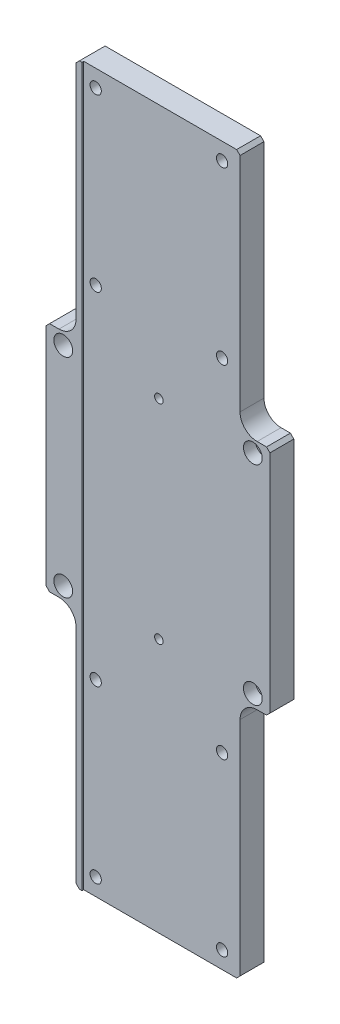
ISO-10303-21;
HEADER;
FILE_DESCRIPTION(('STEP AP214'),'2;1');
FILE_NAME('part.step','',(''),(''),'','','');
FILE_SCHEMA(('AUTOMOTIVE_DESIGN { 1 0 10303 214 1 1 1 1 }'));
ENDSEC;
DATA;
#1=APPLICATION_CONTEXT('core data for automotive mechanical design processes');
#2=APPLICATION_PROTOCOL_DEFINITION('international standard','automotive_design',2000,#1);
#3=PRODUCT_CONTEXT('',#1,'mechanical');
#4=PRODUCT('Part','Part','',(#3));
#5=PRODUCT_RELATED_PRODUCT_CATEGORY('part','',(#4));
#6=PRODUCT_DEFINITION_FORMATION('','',#4);
#7=PRODUCT_DEFINITION_CONTEXT('part definition',#1,'design');
#8=PRODUCT_DEFINITION('design','',#6,#7);
#9=PRODUCT_DEFINITION_SHAPE('','',#8);
#10=(LENGTH_UNIT() NAMED_UNIT(*) SI_UNIT(.MILLI.,.METRE.));
#11=(NAMED_UNIT(*) PLANE_ANGLE_UNIT() SI_UNIT($,.RADIAN.));
#12=(NAMED_UNIT(*) SI_UNIT($,.STERADIAN.) SOLID_ANGLE_UNIT());
#13=UNCERTAINTY_MEASURE_WITH_UNIT(LENGTH_MEASURE(1.E-05),#10,'distance_accuracy_value','');
#14=(GEOMETRIC_REPRESENTATION_CONTEXT(3) GLOBAL_UNCERTAINTY_ASSIGNED_CONTEXT((#13)) GLOBAL_UNIT_ASSIGNED_CONTEXT((#10,
#11,#12)) REPRESENTATION_CONTEXT('',''));
#15=CARTESIAN_POINT('',(0.,0.,0.));
#16=DIRECTION('',(0.,0.,1.));
#17=DIRECTION('',(1.,0.,0.));
#18=AXIS2_PLACEMENT_3D('',#15,#16,#17);
#19=CARTESIAN_POINT('',(47.5,210.,7.5));
#20=DIRECTION('',(1.,0.,0.));
#21=DIRECTION('',(0.,1.,0.));
#22=AXIS2_PLACEMENT_3D('',#19,#20,#21);
#23=PLANE('',#22);
#24=DIRECTION('',(0.,-1.,0.));
#25=VECTOR('',#24,1.);
#26=CARTESIAN_POINT('',(47.5,210.,-7.5));
#27=LINE('',#26,#25);
#28=CARTESIAN_POINT('',(47.5,208.,-7.5));
#29=VERTEX_POINT('',#28);
#30=CARTESIAN_POINT('',(47.5,78.,-7.5));
#31=VERTEX_POINT('',#30);
#32=EDGE_CURVE('E292',#29,#31,#27,.T.);
#33=ORIENTED_EDGE('',*,*,#32,.F.);
#34=DIRECTION('',(0.,0.,1.));
#35=VECTOR('',#34,1.);
#36=CARTESIAN_POINT('',(47.5,208.,7.5));
#37=LINE('',#36,#35);
#38=CARTESIAN_POINT('',(47.5,208.,6.5));
#39=VERTEX_POINT('',#38);
#40=EDGE_CURVE('E424',#29,#39,#37,.T.);
#41=ORIENTED_EDGE('',*,*,#40,.T.);
#42=DIRECTION('',(0.,-1.,0.));
#43=VECTOR('',#42,1.);
#44=CARTESIAN_POINT('',(47.5,210.,6.5));
#45=LINE('',#44,#43);
#46=CARTESIAN_POINT('',(47.5,78.,6.5));
#47=VERTEX_POINT('',#46);
#48=EDGE_CURVE('E268',#39,#47,#45,.T.);
#49=ORIENTED_EDGE('',*,*,#48,.T.);
#50=DIRECTION('',(0.,0.,1.));
#51=VECTOR('',#50,1.);
#52=CARTESIAN_POINT('',(47.5,78.0000000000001,-7.5));
#53=LINE('',#52,#51);
#54=EDGE_CURVE('E364',#47,#31,#53,.F.);
#55=ORIENTED_EDGE('',*,*,#54,.T.);
#56=EDGE_LOOP('',(#33,#41,#49,#55));
#57=FACE_BOUND('',#56,.T.);
#58=ADVANCED_FACE('F59',(#57),#23,.T.);
#59=DIRECTION('',(0.,-1.,0.));
#60=VECTOR('',#59,1.);
#61=CARTESIAN_POINT('',(47.5,210.,6.5));
#62=LINE('',#61,#60);
#63=CARTESIAN_POINT('',(47.5,-77.9999999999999,6.5));
#64=VERTEX_POINT('',#63);
#65=CARTESIAN_POINT('',(47.5,-208.,6.5));
#66=VERTEX_POINT('',#65);
#67=EDGE_CURVE('E274',#64,#66,#62,.T.);
#68=ORIENTED_EDGE('',*,*,#67,.T.);
#69=DIRECTION('',(0.,0.,-1.));
#70=VECTOR('',#69,1.);
#71=CARTESIAN_POINT('',(47.5,-208.,-7.5));
#72=LINE('',#71,#70);
#73=CARTESIAN_POINT('',(47.5,-208.,-7.5));
#74=VERTEX_POINT('',#73);
#75=EDGE_CURVE('E12',#66,#74,#72,.T.);
#76=ORIENTED_EDGE('',*,*,#75,.T.);
#77=CARTESIAN_POINT('',(47.5,-77.9999999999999,-7.5));
#78=VERTEX_POINT('',#77);
#79=EDGE_CURVE('E291',#78,#74,#27,.T.);
#80=ORIENTED_EDGE('',*,*,#79,.F.);
#81=DIRECTION('',(0.,0.,1.));
#82=VECTOR('',#81,1.);
#83=CARTESIAN_POINT('',(47.5,-77.9999999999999,7.5));
#84=LINE('',#83,#82);
#85=EDGE_CURVE('E317',#78,#64,#84,.T.);
#86=ORIENTED_EDGE('',*,*,#85,.T.);
#87=EDGE_LOOP('',(#68,#76,#80,#86));
#88=FACE_BOUND('',#87,.T.);
#89=ADVANCED_FACE('F554',(#88),#23,.T.);
#90=CARTESIAN_POINT('',(-65.,-67.9999999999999,7.5));
#91=DIRECTION('',(0.,1.,0.));
#92=DIRECTION('',(0.,0.,1.));
#93=AXIS2_PLACEMENT_3D('',#90,#91,#92);
#94=PLANE('',#93);
#95=DIRECTION('',(1.,0.,0.));
#96=VECTOR('',#95,1.);
#97=CARTESIAN_POINT('',(-65.,-67.9999999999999,-7.5));
#98=LINE('',#97,#96);
#99=CARTESIAN_POINT('',(57.5,-67.9999999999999,-7.5));
#100=VERTEX_POINT('',#99);
#101=CARTESIAN_POINT('',(63.,-67.9999999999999,-7.5));
#102=VERTEX_POINT('',#101);
#103=EDGE_CURVE('E307',#100,#102,#98,.T.);
#104=ORIENTED_EDGE('',*,*,#103,.T.);
#105=DIRECTION('',(0.,0.,1.));
#106=VECTOR('',#105,1.);
#107=CARTESIAN_POINT('',(63.,-67.9999999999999,6.5));
#108=LINE('',#107,#106);
#109=CARTESIAN_POINT('',(63.,-67.9999999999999,6.5));
#110=VERTEX_POINT('',#109);
#111=EDGE_CURVE('E67',#102,#110,#108,.T.);
#112=ORIENTED_EDGE('',*,*,#111,.T.);
#113=DIRECTION('',(1.,0.,0.));
#114=VECTOR('',#113,1.);
#115=CARTESIAN_POINT('',(-65.,-67.9999999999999,6.5));
#116=LINE('',#115,#114);
#117=CARTESIAN_POINT('',(57.5,-67.9999999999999,6.5));
#118=VERTEX_POINT('',#117);
#119=EDGE_CURVE('E271',#118,#110,#116,.T.);
#120=ORIENTED_EDGE('',*,*,#119,.F.);
#121=DIRECTION('',(0.,0.,1.));
#122=VECTOR('',#121,1.);
#123=CARTESIAN_POINT('',(57.5,-67.9999999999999,7.5));
#124=LINE('',#123,#122);
#125=EDGE_CURVE('E348',#118,#100,#124,.F.);
#126=ORIENTED_EDGE('',*,*,#125,.T.);
#127=EDGE_LOOP('',(#104,#112,#120,#126));
#128=FACE_BOUND('',#127,.T.);
#129=ADVANCED_FACE('F454',(#128),#94,.F.);
#130=CARTESIAN_POINT('',(65.,68.0000000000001,7.5));
#131=DIRECTION('',(1.,0.,0.));
#132=DIRECTION('',(0.,1.,0.));
#133=AXIS2_PLACEMENT_3D('',#130,#131,#132);
#134=PLANE('',#133);
#135=DIRECTION('',(0.,-1.,0.));
#136=VECTOR('',#135,1.);
#137=CARTESIAN_POINT('',(65.,68.0000000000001,-7.5));
#138=LINE('',#137,#136);
#139=CARTESIAN_POINT('',(65.,66.0000000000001,-7.5));
#140=VERTEX_POINT('',#139);
#141=CARTESIAN_POINT('',(65.,-65.9999999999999,-7.5));
#142=VERTEX_POINT('',#141);
#143=EDGE_CURVE('E310',#140,#142,#138,.T.);
#144=ORIENTED_EDGE('',*,*,#143,.F.);
#145=DIRECTION('',(0.,0.,1.));
#146=VECTOR('',#145,1.);
#147=CARTESIAN_POINT('',(65.,66.0000000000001,7.5));
#148=LINE('',#147,#146);
#149=CARTESIAN_POINT('',(65.,66.0000000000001,6.5));
#150=VERTEX_POINT('',#149);
#151=EDGE_CURVE('E409',#140,#150,#148,.T.);
#152=ORIENTED_EDGE('',*,*,#151,.T.);
#153=DIRECTION('',(0.,1.,0.));
#154=VECTOR('',#153,1.);
#155=CARTESIAN_POINT('',(65.,210.,6.5));
#156=LINE('',#155,#154);
#157=CARTESIAN_POINT('',(65.,-66.,6.5));
#158=VERTEX_POINT('',#157);
#159=EDGE_CURVE('E260',#158,#150,#156,.T.);
#160=ORIENTED_EDGE('',*,*,#159,.F.);
#161=DIRECTION('',(0.,0.,-1.));
#162=VECTOR('',#161,1.);
#163=CARTESIAN_POINT('',(65.,-65.9999999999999,-7.5));
#164=LINE('',#163,#162);
#165=EDGE_CURVE('E406',#158,#142,#164,.T.);
#166=ORIENTED_EDGE('',*,*,#165,.T.);
#167=EDGE_LOOP('',(#144,#152,#160,#166));
#168=FACE_BOUND('',#167,.T.);
#169=ADVANCED_FACE('F465',(#168),#134,.T.);
#170=CARTESIAN_POINT('',(-65.,68.0000000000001,7.5));
#171=DIRECTION('',(0.,1.,0.));
#172=DIRECTION('',(0.,0.,1.));
#173=AXIS2_PLACEMENT_3D('',#170,#171,#172);
#174=PLANE('',#173);
#175=DIRECTION('',(1.,0.,0.));
#176=VECTOR('',#175,1.);
#177=CARTESIAN_POINT('',(-65.,68.0000000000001,6.5));
#178=LINE('',#177,#176);
#179=CARTESIAN_POINT('',(57.5,68.0000000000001,6.5));
#180=VERTEX_POINT('',#179);
#181=CARTESIAN_POINT('',(63.,68.0000000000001,6.5));
#182=VERTEX_POINT('',#181);
#183=EDGE_CURVE('E285',#180,#182,#178,.T.);
#184=ORIENTED_EDGE('',*,*,#183,.T.);
#185=DIRECTION('',(0.,0.,-1.));
#186=VECTOR('',#185,1.);
#187=CARTESIAN_POINT('',(63.,68.0000000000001,7.5));
#188=LINE('',#187,#186);
#189=CARTESIAN_POINT('',(63.,68.0000000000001,-7.5));
#190=VERTEX_POINT('',#189);
#191=EDGE_CURVE('E387',#182,#190,#188,.T.);
#192=ORIENTED_EDGE('',*,*,#191,.T.);
#193=DIRECTION('',(1.,0.,0.));
#194=VECTOR('',#193,1.);
#195=CARTESIAN_POINT('',(-65.,68.0000000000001,-7.5));
#196=LINE('',#195,#194);
#197=CARTESIAN_POINT('',(57.5,68.0000000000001,-7.5));
#198=VERTEX_POINT('',#197);
#199=EDGE_CURVE('E313',#198,#190,#196,.T.);
#200=ORIENTED_EDGE('',*,*,#199,.F.);
#201=DIRECTION('',(0.,0.,1.));
#202=VECTOR('',#201,1.);
#203=CARTESIAN_POINT('',(57.5,68.0000000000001,6.5));
#204=LINE('',#203,#202);
#205=EDGE_CURVE('E361',#198,#180,#204,.T.);
#206=ORIENTED_EDGE('',*,*,#205,.T.);
#207=EDGE_LOOP('',(#184,#192,#200,#206));
#208=FACE_BOUND('',#207,.T.);
#209=ADVANCED_FACE('F476',(#208),#174,.T.);
#210=CARTESIAN_POINT('',(-47.5,210.,7.5));
#211=DIRECTION('',(0.,1.,0.));
#212=DIRECTION('',(0.,0.,1.));
#213=AXIS2_PLACEMENT_3D('',#210,#211,#212);
#214=PLANE('',#213);
#215=DIRECTION('',(-1.,0.,0.));
#216=VECTOR('',#215,1.);
#217=CARTESIAN_POINT('',(-44.,210.,6.5));
#218=LINE('',#217,#216);
#219=CARTESIAN_POINT('',(45.5,210.,6.5));
#220=VERTEX_POINT('',#219);
#221=CARTESIAN_POINT('',(-44.,210.,6.5));
#222=VERTEX_POINT('',#221);
#223=EDGE_CURVE('E246',#220,#222,#218,.T.);
#224=ORIENTED_EDGE('',*,*,#223,.F.);
#225=DIRECTION('',(0.,0.,-1.));
#226=VECTOR('',#225,1.);
#227=CARTESIAN_POINT('',(45.5,210.,7.5));
#228=LINE('',#227,#226);
#229=CARTESIAN_POINT('',(45.5,210.,-7.5));
#230=VERTEX_POINT('',#229);
#231=EDGE_CURVE('E421',#220,#230,#228,.T.);
#232=ORIENTED_EDGE('',*,*,#231,.T.);
#233=DIRECTION('',(1.,0.,0.));
#234=VECTOR('',#233,1.);
#235=CARTESIAN_POINT('',(-47.5,210.,-7.5));
#236=LINE('',#235,#234);
#237=CARTESIAN_POINT('',(-45.5,210.,-7.5));
#238=VERTEX_POINT('',#237);
#239=EDGE_CURVE('E294',#238,#230,#236,.T.);
#240=ORIENTED_EDGE('',*,*,#239,.F.);
#241=DIRECTION('',(0.,0.,1.));
#242=VECTOR('',#241,1.);
#243=CARTESIAN_POINT('',(-45.5,210.,7.5));
#244=LINE('',#243,#242);
#245=CARTESIAN_POINT('',(-45.5,210.,7.5));
#246=VERTEX_POINT('',#245);
#247=EDGE_CURVE('E419',#238,#246,#244,.T.);
#248=ORIENTED_EDGE('',*,*,#247,.T.);
#249=DIRECTION('',(1.,0.,0.));
#250=VECTOR('',#249,1.);
#251=CARTESIAN_POINT('',(-47.5,210.,7.5));
#252=LINE('',#251,#250);
#253=CARTESIAN_POINT('',(-44.,210.,7.5));
#254=VERTEX_POINT('',#253);
#255=EDGE_CURVE('E283',#246,#254,#252,.T.);
#256=ORIENTED_EDGE('',*,*,#255,.T.);
#257=DIRECTION('',(0.,0.,1.));
#258=VECTOR('',#257,1.);
#259=CARTESIAN_POINT('',(-44.,210.,6.5));
#260=LINE('',#259,#258);
#261=EDGE_CURVE('E245',#222,#254,#260,.T.);
#262=ORIENTED_EDGE('',*,*,#261,.F.);
#263=EDGE_LOOP('',(#224,#232,#240,#248,#256,#262));
#264=FACE_BOUND('',#263,.T.);
#265=ADVANCED_FACE('F492',(#264),#214,.T.);
#266=CARTESIAN_POINT('',(-47.5,210.,7.5));
#267=DIRECTION('',(1.,0.,0.));
#268=DIRECTION('',(0.,1.,0.));
#269=AXIS2_PLACEMENT_3D('',#266,#267,#268);
#270=PLANE('',#269);
#271=DIRECTION('',(0.,-1.,0.));
#272=VECTOR('',#271,1.);
#273=CARTESIAN_POINT('',(-47.5,210.,7.5));
#274=LINE('',#273,#272);
#275=CARTESIAN_POINT('',(-47.5,208.,7.5));
#276=VERTEX_POINT('',#275);
#277=CARTESIAN_POINT('',(-47.5,78.,7.5));
#278=VERTEX_POINT('',#277);
#279=EDGE_CURVE('E278',#276,#278,#274,.T.);
#280=ORIENTED_EDGE('',*,*,#279,.F.);
#281=DIRECTION('',(0.,0.,-1.));
#282=VECTOR('',#281,1.);
#283=CARTESIAN_POINT('',(-47.5,208.,-7.5));
#284=LINE('',#283,#282);
#285=CARTESIAN_POINT('',(-47.5,208.,-7.5));
#286=VERTEX_POINT('',#285);
#287=EDGE_CURVE('E426',#276,#286,#284,.T.);
#288=ORIENTED_EDGE('',*,*,#287,.T.);
#289=DIRECTION('',(0.,-1.,0.));
#290=VECTOR('',#289,1.);
#291=CARTESIAN_POINT('',(-47.5,210.,-7.5));
#292=LINE('',#291,#290);
#293=CARTESIAN_POINT('',(-47.5,78.,-7.5));
#294=VERTEX_POINT('',#293);
#295=EDGE_CURVE('E286',#286,#294,#292,.T.);
#296=ORIENTED_EDGE('',*,*,#295,.T.);
#297=DIRECTION('',(0.,0.,1.));
#298=VECTOR('',#297,1.);
#299=CARTESIAN_POINT('',(-47.5,78.,7.5));
#300=LINE('',#299,#298);
#301=EDGE_CURVE('E355',#294,#278,#300,.T.);
#302=ORIENTED_EDGE('',*,*,#301,.T.);
#303=EDGE_LOOP('',(#280,#288,#296,#302));
#304=FACE_BOUND('',#303,.T.);
#305=ADVANCED_FACE('F540',(#304),#270,.F.);
#306=CARTESIAN_POINT('',(0.,0.,-7.5));
#307=DIRECTION('',(0.,0.,1.));
#308=DIRECTION('',(1.,0.,0.));
#309=AXIS2_PLACEMENT_3D('',#306,#307,#308);
#310=PLANE('',#309);
#311=CARTESIAN_POINT('',(0.,61.0000000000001,-7.5));
#312=DIRECTION('',(0.,0.,1.));
#313=DIRECTION('',(1.,0.,0.));
#314=AXIS2_PLACEMENT_3D('',#311,#312,#313);
#315=CIRCLE('',#314,2.5);
#316=CARTESIAN_POINT('',(2.5,61.0000000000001,-7.5));
#317=VERTEX_POINT('',#316);
#318=EDGE_CURVE('E1159',#317,#317,#315,.T.);
#319=ORIENTED_EDGE('',*,*,#318,.T.);
#320=EDGE_LOOP('',(#319));
#321=FACE_BOUND('',#320,.T.);
#322=CARTESIAN_POINT('',(0.,-60.9999999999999,-7.5));
#323=DIRECTION('',(0.,0.,1.));
#324=DIRECTION('',(1.,0.,0.));
#325=AXIS2_PLACEMENT_3D('',#322,#323,#324);
#326=CIRCLE('',#325,2.5);
#327=CARTESIAN_POINT('',(2.5,-60.9999999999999,-7.5));
#328=VERTEX_POINT('',#327);
#329=EDGE_CURVE('E1163',#328,#328,#326,.T.);
#330=ORIENTED_EDGE('',*,*,#329,.T.);
#331=EDGE_LOOP('',(#330));
#332=FACE_BOUND('',#331,.T.);
#333=CARTESIAN_POINT('',(-37.,-99.9999999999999,-7.5));
#334=DIRECTION('',(0.,0.,-1.));
#335=DIRECTION('',(-1.,0.,0.));
#336=AXIS2_PLACEMENT_3D('',#333,#334,#335);
#337=CIRCLE('',#336,5.5);
#338=CARTESIAN_POINT('',(-42.5,-99.9999999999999,-7.5));
#339=VERTEX_POINT('',#338);
#340=EDGE_CURVE('E1167',#339,#339,#337,.T.);
#341=ORIENTED_EDGE('',*,*,#340,.F.);
#342=EDGE_LOOP('',(#341));
#343=FACE_BOUND('',#342,.T.);
#344=CARTESIAN_POINT('',(37.,-200.,-7.5));
#345=DIRECTION('',(0.,0.,-1.));
#346=DIRECTION('',(-1.,0.,0.));
#347=AXIS2_PLACEMENT_3D('',#344,#345,#346);
#348=CIRCLE('',#347,5.5);
#349=CARTESIAN_POINT('',(31.5,-200.,-7.5));
#350=VERTEX_POINT('',#349);
#351=EDGE_CURVE('E1171',#350,#350,#348,.T.);
#352=ORIENTED_EDGE('',*,*,#351,.F.);
#353=EDGE_LOOP('',(#352));
#354=FACE_BOUND('',#353,.T.);
#355=CARTESIAN_POINT('',(-37.,-200.,-7.5));
#356=DIRECTION('',(0.,0.,-1.));
#357=DIRECTION('',(-1.,0.,0.));
#358=AXIS2_PLACEMENT_3D('',#355,#356,#357);
#359=CIRCLE('',#358,5.5);
#360=CARTESIAN_POINT('',(-42.5,-200.,-7.5));
#361=VERTEX_POINT('',#360);
#362=EDGE_CURVE('E1175',#361,#361,#359,.T.);
#363=ORIENTED_EDGE('',*,*,#362,.F.);
#364=EDGE_LOOP('',(#363));
#365=FACE_BOUND('',#364,.T.);
#366=CARTESIAN_POINT('',(37.,-99.9999999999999,-7.5));
#367=DIRECTION('',(0.,0.,-1.));
#368=DIRECTION('',(-1.,0.,0.));
#369=AXIS2_PLACEMENT_3D('',#366,#367,#368);
#370=CIRCLE('',#369,5.5);
#371=CARTESIAN_POINT('',(31.5,-99.9999999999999,-7.5));
#372=VERTEX_POINT('',#371);
#373=EDGE_CURVE('E1179',#372,#372,#370,.T.);
#374=ORIENTED_EDGE('',*,*,#373,.F.);
#375=EDGE_LOOP('',(#374));
#376=FACE_BOUND('',#375,.T.);
#377=CARTESIAN_POINT('',(37.,200.,-7.5));
#378=DIRECTION('',(0.,0.,-1.));
#379=DIRECTION('',(-1.,0.,0.));
#380=AXIS2_PLACEMENT_3D('',#377,#378,#379);
#381=CIRCLE('',#380,5.5);
#382=CARTESIAN_POINT('',(31.5,200.,-7.5));
#383=VERTEX_POINT('',#382);
#384=EDGE_CURVE('E1183',#383,#383,#381,.T.);
#385=ORIENTED_EDGE('',*,*,#384,.F.);
#386=EDGE_LOOP('',(#385));
#387=FACE_BOUND('',#386,.T.);
#388=CARTESIAN_POINT('',(-37.,200.,-7.5));
#389=DIRECTION('',(0.,0.,-1.));
#390=DIRECTION('',(-1.,0.,0.));
#391=AXIS2_PLACEMENT_3D('',#388,#389,#390);
#392=CIRCLE('',#391,5.5);
#393=CARTESIAN_POINT('',(-42.5,200.,-7.5));
#394=VERTEX_POINT('',#393);
#395=EDGE_CURVE('E344',#394,#394,#392,.T.);
#396=ORIENTED_EDGE('',*,*,#395,.F.);
#397=EDGE_LOOP('',(#396));
#398=FACE_BOUND('',#397,.T.);
#399=CARTESIAN_POINT('',(37.,100.,-7.5));
#400=DIRECTION('',(0.,0.,-1.));
#401=DIRECTION('',(-1.,0.,0.));
#402=AXIS2_PLACEMENT_3D('',#399,#400,#401);
#403=CIRCLE('',#402,5.5);
#404=CARTESIAN_POINT('',(31.5,100.,-7.5));
#405=VERTEX_POINT('',#404);
#406=EDGE_CURVE('E339',#405,#405,#403,.T.);
#407=ORIENTED_EDGE('',*,*,#406,.F.);
#408=EDGE_LOOP('',(#407));
#409=FACE_BOUND('',#408,.T.);
#410=CARTESIAN_POINT('',(-37.,100.,-7.5));
#411=DIRECTION('',(0.,0.,-1.));
#412=DIRECTION('',(-1.,0.,0.));
#413=AXIS2_PLACEMENT_3D('',#410,#411,#412);
#414=CIRCLE('',#413,5.5);
#415=CARTESIAN_POINT('',(-42.5,100.,-7.5));
#416=VERTEX_POINT('',#415);
#417=EDGE_CURVE('E334',#416,#416,#414,.T.);
#418=ORIENTED_EDGE('',*,*,#417,.F.);
#419=EDGE_LOOP('',(#418));
#420=FACE_BOUND('',#419,.T.);
#421=CARTESIAN_POINT('',(-55.,61.0000000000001,-7.5));
#422=DIRECTION('',(0.,0.,1.));
#423=DIRECTION('',(1.,0.,0.));
#424=AXIS2_PLACEMENT_3D('',#421,#422,#423);
#425=CIRCLE('',#424,3.3);
#426=CARTESIAN_POINT('',(-51.7,61.0000000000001,-7.5));
#427=VERTEX_POINT('',#426);
#428=EDGE_CURVE('E1196',#427,#427,#425,.T.);
#429=ORIENTED_EDGE('',*,*,#428,.T.);
#430=EDGE_LOOP('',(#429));
#431=FACE_BOUND('',#430,.T.);
#432=CARTESIAN_POINT('',(-55.,-60.9999999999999,-7.5));
#433=DIRECTION('',(0.,0.,1.));
#434=DIRECTION('',(1.,0.,0.));
#435=AXIS2_PLACEMENT_3D('',#432,#433,#434);
#436=CIRCLE('',#435,3.3);
#437=CARTESIAN_POINT('',(-51.7,-60.9999999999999,-7.5));
#438=VERTEX_POINT('',#437);
#439=EDGE_CURVE('E1200',#438,#438,#436,.T.);
#440=ORIENTED_EDGE('',*,*,#439,.T.);
#441=EDGE_LOOP('',(#440));
#442=FACE_BOUND('',#441,.T.);
#443=CARTESIAN_POINT('',(55.,61.0000000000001,-7.5));
#444=DIRECTION('',(0.,0.,1.));
#445=DIRECTION('',(1.,0.,0.));
#446=AXIS2_PLACEMENT_3D('',#443,#444,#445);
#447=CIRCLE('',#446,3.3);
#448=CARTESIAN_POINT('',(58.3,61.0000000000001,-7.5));
#449=VERTEX_POINT('',#448);
#450=EDGE_CURVE('E325',#449,#449,#447,.T.);
#451=ORIENTED_EDGE('',*,*,#450,.T.);
#452=EDGE_LOOP('',(#451));
#453=FACE_BOUND('',#452,.T.);
#454=CARTESIAN_POINT('',(55.,-60.9999999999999,-7.5));
#455=DIRECTION('',(0.,0.,1.));
#456=DIRECTION('',(1.,0.,0.));
#457=AXIS2_PLACEMENT_3D('',#454,#455,#456);
#458=CIRCLE('',#457,3.3);
#459=CARTESIAN_POINT('',(58.3,-60.9999999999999,-7.5));
#460=VERTEX_POINT('',#459);
#461=EDGE_CURVE('E320',#460,#460,#458,.T.);
#462=ORIENTED_EDGE('',*,*,#461,.T.);
#463=EDGE_LOOP('',(#462));
#464=FACE_BOUND('',#463,.T.);
#465=ORIENTED_EDGE('',*,*,#199,.T.);
#466=DIRECTION('',(-0.707106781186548,0.707106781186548,0.));
#467=VECTOR('',#466,1.);
#468=CARTESIAN_POINT('',(63.,68.0000000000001,-7.5));
#469=LINE('',#468,#467);
#470=EDGE_CURVE('E404',#190,#140,#469,.F.);
#471=ORIENTED_EDGE('',*,*,#470,.T.);
#472=ORIENTED_EDGE('',*,*,#143,.T.);
#473=DIRECTION('',(-0.707106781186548,-0.707106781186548,0.));
#474=VECTOR('',#473,1.);
#475=CARTESIAN_POINT('',(65.,-65.9999999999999,-7.5));
#476=LINE('',#475,#474);
#477=EDGE_CURVE('E392',#142,#102,#476,.T.);
#478=ORIENTED_EDGE('',*,*,#477,.T.);
#479=ORIENTED_EDGE('',*,*,#103,.F.);
#480=CARTESIAN_POINT('',(57.5,-77.9999999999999,-7.5));
#481=DIRECTION('',(0.,0.,1.));
#482=DIRECTION('',(1.,0.,0.));
#483=AXIS2_PLACEMENT_3D('',#480,#481,#482);
#484=CIRCLE('',#483,10.);
#485=EDGE_CURVE('E369',#100,#78,#484,.T.);
#486=ORIENTED_EDGE('',*,*,#485,.T.);
#487=ORIENTED_EDGE('',*,*,#79,.T.);
#488=DIRECTION('',(-0.707106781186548,-0.707106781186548,0.));
#489=VECTOR('',#488,1.);
#490=CARTESIAN_POINT('',(47.5,-208.,-7.5));
#491=LINE('',#490,#489);
#492=CARTESIAN_POINT('',(45.5,-210.,-7.5));
#493=VERTEX_POINT('',#492);
#494=EDGE_CURVE('E390',#74,#493,#491,.T.);
#495=ORIENTED_EDGE('',*,*,#494,.T.);
#496=DIRECTION('',(1.,0.,0.));
#497=VECTOR('',#496,1.);
#498=CARTESIAN_POINT('',(-47.5,-210.,-7.5));
#499=LINE('',#498,#497);
#500=CARTESIAN_POINT('',(-45.5,-210.,-7.5));
#501=VERTEX_POINT('',#500);
#502=EDGE_CURVE('E288',#501,#493,#499,.T.);
#503=ORIENTED_EDGE('',*,*,#502,.F.);
#504=DIRECTION('',(0.707106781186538,-0.707106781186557,0.));
#505=VECTOR('',#504,1.);
#506=CARTESIAN_POINT('',(-45.5,-210.,-7.5));
#507=LINE('',#506,#505);
#508=CARTESIAN_POINT('',(-47.5,-208.,-7.5));
#509=VERTEX_POINT('',#508);
#510=EDGE_CURVE('E394',#501,#509,#507,.F.);
#511=ORIENTED_EDGE('',*,*,#510,.T.);
#512=CARTESIAN_POINT('',(-47.5,-77.9999999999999,-7.5));
#513=VERTEX_POINT('',#512);
#514=EDGE_CURVE('E289',#513,#509,#292,.T.);
#515=ORIENTED_EDGE('',*,*,#514,.F.);
#516=CARTESIAN_POINT('',(-57.5,-77.9999999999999,-7.5));
#517=DIRECTION('',(0.,0.,1.));
#518=DIRECTION('',(1.,0.,0.));
#519=AXIS2_PLACEMENT_3D('',#516,#517,#518);
#520=CIRCLE('',#519,10.);
#521=CARTESIAN_POINT('',(-57.5,-67.9999999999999,-7.5));
#522=VERTEX_POINT('',#521);
#523=EDGE_CURVE('E373',#513,#522,#520,.T.);
#524=ORIENTED_EDGE('',*,*,#523,.T.);
#525=CARTESIAN_POINT('',(-63.,-67.9999999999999,-7.5));
#526=VERTEX_POINT('',#525);
#527=EDGE_CURVE('E308',#526,#522,#98,.T.);
#528=ORIENTED_EDGE('',*,*,#527,.F.);
#529=DIRECTION('',(0.707106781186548,-0.707106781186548,0.));
#530=VECTOR('',#529,1.);
#531=CARTESIAN_POINT('',(-63.,-67.9999999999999,-7.5));
#532=LINE('',#531,#530);
#533=CARTESIAN_POINT('',(-65.,-65.9999999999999,-7.5));
#534=VERTEX_POINT('',#533);
#535=EDGE_CURVE('E396',#526,#534,#532,.F.);
#536=ORIENTED_EDGE('',*,*,#535,.T.);
#537=DIRECTION('',(0.,-1.,0.));
#538=VECTOR('',#537,1.);
#539=CARTESIAN_POINT('',(-65.,68.0000000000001,-7.5));
#540=LINE('',#539,#538);
#541=CARTESIAN_POINT('',(-65.,66.0000000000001,-7.5));
#542=VERTEX_POINT('',#541);
#543=EDGE_CURVE('E277',#542,#534,#540,.T.);
#544=ORIENTED_EDGE('',*,*,#543,.F.);
#545=DIRECTION('',(0.707106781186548,0.707106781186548,0.));
#546=VECTOR('',#545,1.);
#547=CARTESIAN_POINT('',(-65.,66.0000000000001,-7.5));
#548=LINE('',#547,#546);
#549=CARTESIAN_POINT('',(-63.,68.0000000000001,-7.5));
#550=VERTEX_POINT('',#549);
#551=EDGE_CURVE('E398',#542,#550,#548,.T.);
#552=ORIENTED_EDGE('',*,*,#551,.T.);
#553=CARTESIAN_POINT('',(-57.5,68.0000000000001,-7.5));
#554=VERTEX_POINT('',#553);
#555=EDGE_CURVE('E301',#550,#554,#196,.T.);
#556=ORIENTED_EDGE('',*,*,#555,.T.);
#557=CARTESIAN_POINT('',(-57.5,78.,-7.5));
#558=DIRECTION('',(0.,0.,1.));
#559=DIRECTION('',(1.,0.,0.));
#560=AXIS2_PLACEMENT_3D('',#557,#558,#559);
#561=CIRCLE('',#560,10.);
#562=EDGE_CURVE('E379',#554,#294,#561,.T.);
#563=ORIENTED_EDGE('',*,*,#562,.T.);
#564=ORIENTED_EDGE('',*,*,#295,.F.);
#565=DIRECTION('',(0.707106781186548,0.707106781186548,0.));
#566=VECTOR('',#565,1.);
#567=CARTESIAN_POINT('',(-47.5,208.,-7.5));
#568=LINE('',#567,#566);
#569=EDGE_CURVE('E400',#286,#238,#568,.T.);
#570=ORIENTED_EDGE('',*,*,#569,.T.);
#571=ORIENTED_EDGE('',*,*,#239,.T.);
#572=DIRECTION('',(-0.707106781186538,0.707106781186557,0.));
#573=VECTOR('',#572,1.);
#574=CARTESIAN_POINT('',(45.5,210.,-7.5));
#575=LINE('',#574,#573);
#576=EDGE_CURVE('E402',#230,#29,#575,.F.);
#577=ORIENTED_EDGE('',*,*,#576,.T.);
#578=ORIENTED_EDGE('',*,*,#32,.T.);
#579=CARTESIAN_POINT('',(57.5,78.0000000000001,-7.5));
#580=DIRECTION('',(0.,0.,1.));
#581=DIRECTION('',(1.,0.,0.));
#582=AXIS2_PLACEMENT_3D('',#579,#580,#581);
#583=CIRCLE('',#582,10.);
#584=EDGE_CURVE('E385',#31,#198,#583,.T.);
#585=ORIENTED_EDGE('',*,*,#584,.T.);
#586=EDGE_LOOP('',(#465,#471,#472,#478,#479,#486,#487,#495,#503,#511,#515,#524,#528,#536,#544,
#552,#556,#563,#564,#570,#571,#577,#578,#585));
#587=FACE_BOUND('',#586,.T.);
#588=ADVANCED_FACE('F469',(#321,#332,#343,#354,#365,#376,#387,#398,#409,#420,#431,#442,#453,
#464,#587),#310,.F.);
#589=CARTESIAN_POINT('',(0.,0.,7.5));
#590=DIRECTION('',(0.,0.,1.));
#591=DIRECTION('',(1.,0.,0.));
#592=AXIS2_PLACEMENT_3D('',#589,#590,#591);
#593=PLANE('',#592);
#594=CARTESIAN_POINT('',(-55.,61.0000000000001,7.5));
#595=DIRECTION('',(0.,0.,1.));
#596=DIRECTION('',(1.,0.,0.));
#597=AXIS2_PLACEMENT_3D('',#594,#595,#596);
#598=CIRCLE('',#597,5.5);
#599=CARTESIAN_POINT('',(-49.5,61.0000000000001,7.5));
#600=VERTEX_POINT('',#599);
#601=EDGE_CURVE('E329',#600,#600,#598,.T.);
#602=ORIENTED_EDGE('',*,*,#601,.F.);
#603=EDGE_LOOP('',(#602));
#604=FACE_BOUND('',#603,.T.);
#605=CARTESIAN_POINT('',(-55.,-60.9999999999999,7.5));
#606=DIRECTION('',(0.,0.,1.));
#607=DIRECTION('',(1.,0.,0.));
#608=AXIS2_PLACEMENT_3D('',#605,#606,#607);
#609=CIRCLE('',#608,5.5);
#610=CARTESIAN_POINT('',(-49.5,-60.9999999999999,7.5));
#611=VERTEX_POINT('',#610);
#612=EDGE_CURVE('E1226',#611,#611,#609,.T.);
#613=ORIENTED_EDGE('',*,*,#612,.F.);
#614=EDGE_LOOP('',(#613));
#615=FACE_BOUND('',#614,.T.);
#616=ORIENTED_EDGE('',*,*,#255,.F.);
#617=DIRECTION('',(-0.707106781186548,-0.707106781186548,0.));
#618=VECTOR('',#617,1.);
#619=CARTESIAN_POINT('',(-127.75,127.75,7.5));
#620=LINE('',#619,#618);
#621=EDGE_CURVE('E434',#246,#276,#620,.T.);
#622=ORIENTED_EDGE('',*,*,#621,.T.);
#623=ORIENTED_EDGE('',*,*,#279,.T.);
#624=CARTESIAN_POINT('',(-57.5,78.,7.5));
#625=DIRECTION('',(0.,0.,1.));
#626=DIRECTION('',(1.,0.,0.));
#627=AXIS2_PLACEMENT_3D('',#624,#625,#626);
#628=CIRCLE('',#627,10.);
#629=CARTESIAN_POINT('',(-57.5,68.0000000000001,7.5));
#630=VERTEX_POINT('',#629);
#631=EDGE_CURVE('E376',#278,#630,#628,.F.);
#632=ORIENTED_EDGE('',*,*,#631,.T.);
#633=DIRECTION('',(1.,0.,0.));
#634=VECTOR('',#633,1.);
#635=CARTESIAN_POINT('',(-65.,68.0000000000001,7.5));
#636=LINE('',#635,#634);
#637=CARTESIAN_POINT('',(-63.,68.0000000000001,7.5));
#638=VERTEX_POINT('',#637);
#639=EDGE_CURVE('E303',#638,#630,#636,.T.);
#640=ORIENTED_EDGE('',*,*,#639,.F.);
#641=DIRECTION('',(-0.707106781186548,-0.707106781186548,0.));
#642=VECTOR('',#641,1.);
#643=CARTESIAN_POINT('',(-65.5,65.5,7.5));
#644=LINE('',#643,#642);
#645=CARTESIAN_POINT('',(-65.,66.0000000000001,7.5));
#646=VERTEX_POINT('',#645);
#647=EDGE_CURVE('E432',#638,#646,#644,.T.);
#648=ORIENTED_EDGE('',*,*,#647,.T.);
#649=DIRECTION('',(0.,-1.,0.));
#650=VECTOR('',#649,1.);
#651=CARTESIAN_POINT('',(-65.,68.0000000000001,7.5));
#652=LINE('',#651,#650);
#653=CARTESIAN_POINT('',(-65.,-65.9999999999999,7.5));
#654=VERTEX_POINT('',#653);
#655=EDGE_CURVE('E297',#646,#654,#652,.T.);
#656=ORIENTED_EDGE('',*,*,#655,.T.);
#657=DIRECTION('',(-0.707106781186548,0.707106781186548,0.));
#658=VECTOR('',#657,1.);
#659=CARTESIAN_POINT('',(-65.5,-65.5,7.5));
#660=LINE('',#659,#658);
#661=CARTESIAN_POINT('',(-63.,-67.9999999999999,7.5));
#662=VERTEX_POINT('',#661);
#663=EDGE_CURVE('E430',#654,#662,#660,.F.);
#664=ORIENTED_EDGE('',*,*,#663,.T.);
#665=DIRECTION('',(1.,0.,0.));
#666=VECTOR('',#665,1.);
#667=CARTESIAN_POINT('',(-65.,-67.9999999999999,7.5));
#668=LINE('',#667,#666);
#669=CARTESIAN_POINT('',(-57.5,-67.9999999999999,7.5));
#670=VERTEX_POINT('',#669);
#671=EDGE_CURVE('E300',#662,#670,#668,.T.);
#672=ORIENTED_EDGE('',*,*,#671,.T.);
#673=CARTESIAN_POINT('',(-57.5,-77.9999999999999,7.5));
#674=DIRECTION('',(0.,0.,1.));
#675=DIRECTION('',(1.,0.,0.));
#676=AXIS2_PLACEMENT_3D('',#673,#674,#675);
#677=CIRCLE('',#676,10.);
#678=CARTESIAN_POINT('',(-47.5,-77.9999999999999,7.5));
#679=VERTEX_POINT('',#678);
#680=EDGE_CURVE('E371',#670,#679,#677,.F.);
#681=ORIENTED_EDGE('',*,*,#680,.T.);
#682=CARTESIAN_POINT('',(-47.5,-208.,7.5));
#683=VERTEX_POINT('',#682);
#684=EDGE_CURVE('E281',#679,#683,#274,.T.);
#685=ORIENTED_EDGE('',*,*,#684,.T.);
#686=DIRECTION('',(-0.707106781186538,0.707106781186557,0.));
#687=VECTOR('',#686,1.);
#688=CARTESIAN_POINT('',(-127.750000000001,-127.749999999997,7.5));
#689=LINE('',#688,#687);
#690=CARTESIAN_POINT('',(-45.5,-210.,7.5));
#691=VERTEX_POINT('',#690);
#692=EDGE_CURVE('E74',#683,#691,#689,.F.);
#693=ORIENTED_EDGE('',*,*,#692,.T.);
#694=DIRECTION('',(1.,0.,0.));
#695=VECTOR('',#694,1.);
#696=CARTESIAN_POINT('',(-47.5,-210.,7.5));
#697=LINE('',#696,#695);
#698=CARTESIAN_POINT('',(-44.,-210.,7.5));
#699=VERTEX_POINT('',#698);
#700=EDGE_CURVE('E280',#691,#699,#697,.T.);
#701=ORIENTED_EDGE('',*,*,#700,.T.);
#702=DIRECTION('',(0.,-1.,0.));
#703=VECTOR('',#702,1.);
#704=CARTESIAN_POINT('',(-44.,210.,7.5));
#705=LINE('',#704,#703);
#706=EDGE_CURVE('E242',#254,#699,#705,.T.);
#707=ORIENTED_EDGE('',*,*,#706,.F.);
#708=EDGE_LOOP('',(#616,#622,#623,#632,#640,#648,#656,#664,#672,#681,#685,#693,#701,#707));
#709=FACE_BOUND('',#708,.T.);
#710=ADVANCED_FACE('F495',(#604,#615,#709),#593,.T.);
#711=ORIENTED_EDGE('',*,*,#514,.T.);
#712=DIRECTION('',(0.,0.,1.));
#713=VECTOR('',#712,1.);
#714=CARTESIAN_POINT('',(-47.5,-208.,7.5));
#715=LINE('',#714,#713);
#716=EDGE_CURVE('E82',#509,#683,#715,.T.);
#717=ORIENTED_EDGE('',*,*,#716,.T.);
#718=ORIENTED_EDGE('',*,*,#684,.F.);
#719=DIRECTION('',(0.,0.,1.));
#720=VECTOR('',#719,1.);
#721=CARTESIAN_POINT('',(-47.5,-77.9999999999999,-7.5));
#722=LINE('',#721,#720);
#723=EDGE_CURVE('E353',#679,#513,#722,.F.);
#724=ORIENTED_EDGE('',*,*,#723,.T.);
#725=EDGE_LOOP('',(#711,#717,#718,#724));
#726=FACE_BOUND('',#725,.T.);
#727=ADVANCED_FACE('F503',(#726),#270,.F.);
#728=CARTESIAN_POINT('',(-47.5,-210.,7.5));
#729=DIRECTION('',(0.,1.,0.));
#730=DIRECTION('',(0.,0.,1.));
#731=AXIS2_PLACEMENT_3D('',#728,#729,#730);
#732=PLANE('',#731);
#733=ORIENTED_EDGE('',*,*,#700,.F.);
#734=DIRECTION('',(0.,0.,-1.));
#735=VECTOR('',#734,1.);
#736=CARTESIAN_POINT('',(-45.5,-210.,7.5));
#737=LINE('',#736,#735);
#738=EDGE_CURVE('E447',#691,#501,#737,.T.);
#739=ORIENTED_EDGE('',*,*,#738,.T.);
#740=ORIENTED_EDGE('',*,*,#502,.T.);
#741=DIRECTION('',(0.,0.,1.));
#742=VECTOR('',#741,1.);
#743=CARTESIAN_POINT('',(45.5,-210.,6.5));
#744=LINE('',#743,#742);
#745=CARTESIAN_POINT('',(45.5,-210.,6.5));
#746=VERTEX_POINT('',#745);
#747=EDGE_CURVE('E259',#493,#746,#744,.T.);
#748=ORIENTED_EDGE('',*,*,#747,.T.);
#749=DIRECTION('',(1.,0.,0.));
#750=VECTOR('',#749,1.);
#751=CARTESIAN_POINT('',(-44.,-210.,6.5));
#752=LINE('',#751,#750);
#753=CARTESIAN_POINT('',(-44.,-210.,6.5));
#754=VERTEX_POINT('',#753);
#755=EDGE_CURVE('E252',#754,#746,#752,.T.);
#756=ORIENTED_EDGE('',*,*,#755,.F.);
#757=DIRECTION('',(0.,0.,1.));
#758=VECTOR('',#757,1.);
#759=CARTESIAN_POINT('',(-44.,-210.,6.5));
#760=LINE('',#759,#758);
#761=EDGE_CURVE('E235',#754,#699,#760,.T.);
#762=ORIENTED_EDGE('',*,*,#761,.T.);
#763=EDGE_LOOP('',(#733,#739,#740,#748,#756,#762));
#764=FACE_BOUND('',#763,.T.);
#765=ADVANCED_FACE('F256',(#764),#732,.F.);
#766=CARTESIAN_POINT('',(-65.,68.0000000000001,7.5));
#767=DIRECTION('',(1.,0.,0.));
#768=DIRECTION('',(0.,1.,0.));
#769=AXIS2_PLACEMENT_3D('',#766,#767,#768);
#770=PLANE('',#769);
#771=ORIENTED_EDGE('',*,*,#655,.F.);
#772=DIRECTION('',(0.,0.,-1.));
#773=VECTOR('',#772,1.);
#774=CARTESIAN_POINT('',(-65.,66.0000000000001,-7.5));
#775=LINE('',#774,#773);
#776=EDGE_CURVE('E438',#646,#542,#775,.T.);
#777=ORIENTED_EDGE('',*,*,#776,.T.);
#778=ORIENTED_EDGE('',*,*,#543,.T.);
#779=DIRECTION('',(0.,0.,1.));
#780=VECTOR('',#779,1.);
#781=CARTESIAN_POINT('',(-65.,-65.9999999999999,7.5));
#782=LINE('',#781,#780);
#783=EDGE_CURVE('E436',#534,#654,#782,.T.);
#784=ORIENTED_EDGE('',*,*,#783,.T.);
#785=EDGE_LOOP('',(#771,#777,#778,#784));
#786=FACE_BOUND('',#785,.T.);
#787=ADVANCED_FACE('F521',(#786),#770,.F.);
#788=ORIENTED_EDGE('',*,*,#671,.F.);
#789=DIRECTION('',(0.,0.,-1.));
#790=VECTOR('',#789,1.);
#791=CARTESIAN_POINT('',(-63.,-67.9999999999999,7.5));
#792=LINE('',#791,#790);
#793=EDGE_CURVE('E443',#662,#526,#792,.T.);
#794=ORIENTED_EDGE('',*,*,#793,.T.);
#795=ORIENTED_EDGE('',*,*,#527,.T.);
#796=DIRECTION('',(0.,0.,1.));
#797=VECTOR('',#796,1.);
#798=CARTESIAN_POINT('',(-57.5,-67.9999999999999,7.5));
#799=LINE('',#798,#797);
#800=EDGE_CURVE('E350',#522,#670,#799,.T.);
#801=ORIENTED_EDGE('',*,*,#800,.T.);
#802=EDGE_LOOP('',(#788,#794,#795,#801));
#803=FACE_BOUND('',#802,.T.);
#804=ADVANCED_FACE('F513',(#803),#94,.F.);
#805=ORIENTED_EDGE('',*,*,#555,.F.);
#806=DIRECTION('',(0.,0.,1.));
#807=VECTOR('',#806,1.);
#808=CARTESIAN_POINT('',(-63.,68.0000000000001,7.5));
#809=LINE('',#808,#807);
#810=EDGE_CURVE('E441',#550,#638,#809,.T.);
#811=ORIENTED_EDGE('',*,*,#810,.T.);
#812=ORIENTED_EDGE('',*,*,#639,.T.);
#813=DIRECTION('',(0.,0.,1.));
#814=VECTOR('',#813,1.);
#815=CARTESIAN_POINT('',(-57.5,68.0000000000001,7.5));
#816=LINE('',#815,#814);
#817=EDGE_CURVE('E358',#630,#554,#816,.F.);
#818=ORIENTED_EDGE('',*,*,#817,.T.);
#819=EDGE_LOOP('',(#805,#811,#812,#818));
#820=FACE_BOUND('',#819,.T.);
#821=ADVANCED_FACE('F530',(#820),#174,.T.);
#822=CARTESIAN_POINT('',(-44.,210.,6.5));
#823=DIRECTION('',(-1.,0.,0.));
#824=DIRECTION('',(0.,-1.,0.));
#825=AXIS2_PLACEMENT_3D('',#822,#823,#824);
#826=PLANE('',#825);
#827=ORIENTED_EDGE('',*,*,#706,.T.);
#828=ORIENTED_EDGE('',*,*,#761,.F.);
#829=DIRECTION('',(0.,-1.,0.));
#830=VECTOR('',#829,1.);
#831=CARTESIAN_POINT('',(-44.,210.,6.5));
#832=LINE('',#831,#830);
#833=EDGE_CURVE('E239',#222,#754,#832,.T.);
#834=ORIENTED_EDGE('',*,*,#833,.F.);
#835=ORIENTED_EDGE('',*,*,#261,.T.);
#836=EDGE_LOOP('',(#827,#828,#834,#835));
#837=FACE_BOUND('',#836,.T.);
#838=ADVANCED_FACE('F237',(#837),#826,.F.);
#839=CARTESIAN_POINT('',(0.,0.,6.5));
#840=DIRECTION('',(0.,0.,1.));
#841=DIRECTION('',(1.,0.,0.));
#842=AXIS2_PLACEMENT_3D('',#839,#840,#841);
#843=PLANE('',#842);
#844=CARTESIAN_POINT('',(0.,61.0000000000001,6.5));
#845=DIRECTION('',(0.,0.,1.));
#846=DIRECTION('',(1.,0.,0.));
#847=AXIS2_PLACEMENT_3D('',#844,#845,#846);
#848=CIRCLE('',#847,2.49999999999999);
#849=CARTESIAN_POINT('',(2.49999999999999,61.0000000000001,6.5));
#850=VERTEX_POINT('',#849);
#851=EDGE_CURVE('E1307',#850,#850,#848,.T.);
#852=ORIENTED_EDGE('',*,*,#851,.F.);
#853=EDGE_LOOP('',(#852));
#854=FACE_BOUND('',#853,.T.);
#855=CARTESIAN_POINT('',(0.,-60.9999999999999,6.5));
#856=DIRECTION('',(0.,0.,1.));
#857=DIRECTION('',(1.,0.,0.));
#858=AXIS2_PLACEMENT_3D('',#855,#856,#857);
#859=CIRCLE('',#858,2.49999999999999);
#860=CARTESIAN_POINT('',(2.49999999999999,-60.9999999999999,6.5));
#861=VERTEX_POINT('',#860);
#862=EDGE_CURVE('E1303',#861,#861,#859,.T.);
#863=ORIENTED_EDGE('',*,*,#862,.F.);
#864=EDGE_LOOP('',(#863));
#865=FACE_BOUND('',#864,.T.);
#866=CARTESIAN_POINT('',(-37.,-99.9999999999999,6.5));
#867=DIRECTION('',(0.,0.,1.));
#868=DIRECTION('',(1.,0.,0.));
#869=AXIS2_PLACEMENT_3D('',#866,#867,#868);
#870=CIRCLE('',#869,3.3);
#871=CARTESIAN_POINT('',(-33.7,-99.9999999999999,6.5));
#872=VERTEX_POINT('',#871);
#873=EDGE_CURVE('E1298',#872,#872,#870,.T.);
#874=ORIENTED_EDGE('',*,*,#873,.F.);
#875=EDGE_LOOP('',(#874));
#876=FACE_BOUND('',#875,.T.);
#877=CARTESIAN_POINT('',(37.,-200.,6.5));
#878=DIRECTION('',(0.,0.,1.));
#879=DIRECTION('',(1.,0.,0.));
#880=AXIS2_PLACEMENT_3D('',#877,#878,#879);
#881=CIRCLE('',#880,3.3);
#882=CARTESIAN_POINT('',(40.3,-200.,6.5));
#883=VERTEX_POINT('',#882);
#884=EDGE_CURVE('E1288',#883,#883,#881,.T.);
#885=ORIENTED_EDGE('',*,*,#884,.F.);
#886=EDGE_LOOP('',(#885));
#887=FACE_BOUND('',#886,.T.);
#888=CARTESIAN_POINT('',(-37.,-200.,6.5));
#889=DIRECTION('',(0.,0.,1.));
#890=DIRECTION('',(1.,0.,0.));
#891=AXIS2_PLACEMENT_3D('',#888,#889,#890);
#892=CIRCLE('',#891,3.3);
#893=CARTESIAN_POINT('',(-33.7,-200.,6.5));
#894=VERTEX_POINT('',#893);
#895=EDGE_CURVE('E1278',#894,#894,#892,.T.);
#896=ORIENTED_EDGE('',*,*,#895,.F.);
#897=EDGE_LOOP('',(#896));
#898=FACE_BOUND('',#897,.T.);
#899=CARTESIAN_POINT('',(37.,-99.9999999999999,6.5));
#900=DIRECTION('',(0.,0.,1.));
#901=DIRECTION('',(1.,0.,0.));
#902=AXIS2_PLACEMENT_3D('',#899,#900,#901);
#903=CIRCLE('',#902,3.3);
#904=CARTESIAN_POINT('',(40.3,-99.9999999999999,6.5));
#905=VERTEX_POINT('',#904);
#906=EDGE_CURVE('E1268',#905,#905,#903,.T.);
#907=ORIENTED_EDGE('',*,*,#906,.F.);
#908=EDGE_LOOP('',(#907));
#909=FACE_BOUND('',#908,.T.);
#910=CARTESIAN_POINT('',(37.,200.,6.5));
#911=DIRECTION('',(0.,0.,1.));
#912=DIRECTION('',(1.,0.,0.));
#913=AXIS2_PLACEMENT_3D('',#910,#911,#912);
#914=CIRCLE('',#913,3.3);
#915=CARTESIAN_POINT('',(40.3,200.,6.5));
#916=VERTEX_POINT('',#915);
#917=EDGE_CURVE('E341',#916,#916,#914,.T.);
#918=ORIENTED_EDGE('',*,*,#917,.F.);
#919=EDGE_LOOP('',(#918));
#920=FACE_BOUND('',#919,.T.);
#921=CARTESIAN_POINT('',(-37.,200.,6.5));
#922=DIRECTION('',(0.,0.,1.));
#923=DIRECTION('',(1.,0.,0.));
#924=AXIS2_PLACEMENT_3D('',#921,#922,#923);
#925=CIRCLE('',#924,3.3);
#926=CARTESIAN_POINT('',(-33.7,200.,6.5));
#927=VERTEX_POINT('',#926);
#928=EDGE_CURVE('E336',#927,#927,#925,.T.);
#929=ORIENTED_EDGE('',*,*,#928,.F.);
#930=EDGE_LOOP('',(#929));
#931=FACE_BOUND('',#930,.T.);
#932=CARTESIAN_POINT('',(37.,100.,6.5));
#933=DIRECTION('',(0.,0.,1.));
#934=DIRECTION('',(1.,0.,0.));
#935=AXIS2_PLACEMENT_3D('',#932,#933,#934);
#936=CIRCLE('',#935,3.3);
#937=CARTESIAN_POINT('',(40.3,100.,6.5));
#938=VERTEX_POINT('',#937);
#939=EDGE_CURVE('E331',#938,#938,#936,.T.);
#940=ORIENTED_EDGE('',*,*,#939,.F.);
#941=EDGE_LOOP('',(#940));
#942=FACE_BOUND('',#941,.T.);
#943=CARTESIAN_POINT('',(-37.,100.,6.5));
#944=DIRECTION('',(0.,0.,1.));
#945=DIRECTION('',(1.,0.,0.));
#946=AXIS2_PLACEMENT_3D('',#943,#944,#945);
#947=CIRCLE('',#946,3.3);
#948=CARTESIAN_POINT('',(-33.7,100.,6.5));
#949=VERTEX_POINT('',#948);
#950=EDGE_CURVE('E326',#949,#949,#947,.T.);
#951=ORIENTED_EDGE('',*,*,#950,.F.);
#952=EDGE_LOOP('',(#951));
#953=FACE_BOUND('',#952,.T.);
#954=CARTESIAN_POINT('',(55.,61.0000000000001,6.5));
#955=DIRECTION('',(0.,0.,1.));
#956=DIRECTION('',(1.,0.,0.));
#957=AXIS2_PLACEMENT_3D('',#954,#955,#956);
#958=CIRCLE('',#957,5.5);
#959=CARTESIAN_POINT('',(60.5,61.0000000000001,6.5));
#960=VERTEX_POINT('',#959);
#961=EDGE_CURVE('E321',#960,#960,#958,.T.);
#962=ORIENTED_EDGE('',*,*,#961,.F.);
#963=EDGE_LOOP('',(#962));
#964=FACE_BOUND('',#963,.T.);
#965=CARTESIAN_POINT('',(55.,-60.9999999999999,6.5));
#966=DIRECTION('',(0.,0.,1.));
#967=DIRECTION('',(1.,0.,0.));
#968=AXIS2_PLACEMENT_3D('',#965,#966,#967);
#969=CIRCLE('',#968,5.5);
#970=CARTESIAN_POINT('',(60.5,-60.9999999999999,6.5));
#971=VERTEX_POINT('',#970);
#972=EDGE_CURVE('E267',#971,#971,#969,.T.);
#973=ORIENTED_EDGE('',*,*,#972,.F.);
#974=EDGE_LOOP('',(#973));
#975=FACE_BOUND('',#974,.T.);
#976=ORIENTED_EDGE('',*,*,#159,.T.);
#977=DIRECTION('',(0.707106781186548,-0.707106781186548,0.));
#978=VECTOR('',#977,1.);
#979=CARTESIAN_POINT('',(65.5,65.5,6.5));
#980=LINE('',#979,#978);
#981=EDGE_CURVE('E417',#150,#182,#980,.F.);
#982=ORIENTED_EDGE('',*,*,#981,.T.);
#983=ORIENTED_EDGE('',*,*,#183,.F.);
#984=CARTESIAN_POINT('',(57.5,78.0000000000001,6.5));
#985=DIRECTION('',(0.,0.,1.));
#986=DIRECTION('',(1.,0.,0.));
#987=AXIS2_PLACEMENT_3D('',#984,#985,#986);
#988=CIRCLE('',#987,10.);
#989=EDGE_CURVE('E382',#180,#47,#988,.F.);
#990=ORIENTED_EDGE('',*,*,#989,.T.);
#991=ORIENTED_EDGE('',*,*,#48,.F.);
#992=DIRECTION('',(0.707106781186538,-0.707106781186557,0.));
#993=VECTOR('',#992,1.);
#994=CARTESIAN_POINT('',(127.750000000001,127.749999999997,6.5));
#995=LINE('',#994,#993);
#996=EDGE_CURVE('E415',#39,#220,#995,.F.);
#997=ORIENTED_EDGE('',*,*,#996,.T.);
#998=ORIENTED_EDGE('',*,*,#223,.T.);
#999=ORIENTED_EDGE('',*,*,#833,.T.);
#1000=ORIENTED_EDGE('',*,*,#755,.T.);
#1001=DIRECTION('',(0.707106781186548,0.707106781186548,0.));
#1002=VECTOR('',#1001,1.);
#1003=CARTESIAN_POINT('',(127.75,-127.75,6.5));
#1004=LINE('',#1003,#1002);
#1005=EDGE_CURVE('E411',#746,#66,#1004,.T.);
#1006=ORIENTED_EDGE('',*,*,#1005,.T.);
#1007=ORIENTED_EDGE('',*,*,#67,.F.);
#1008=CARTESIAN_POINT('',(57.5,-77.9999999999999,6.5));
#1009=DIRECTION('',(0.,0.,1.));
#1010=DIRECTION('',(1.,0.,0.));
#1011=AXIS2_PLACEMENT_3D('',#1008,#1009,#1010);
#1012=CIRCLE('',#1011,10.);
#1013=EDGE_CURVE('E367',#64,#118,#1012,.F.);
#1014=ORIENTED_EDGE('',*,*,#1013,.T.);
#1015=ORIENTED_EDGE('',*,*,#119,.T.);
#1016=DIRECTION('',(0.707106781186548,0.707106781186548,0.));
#1017=VECTOR('',#1016,1.);
#1018=CARTESIAN_POINT('',(65.5,-65.5,6.5));
#1019=LINE('',#1018,#1017);
#1020=EDGE_CURVE('E413',#110,#158,#1019,.T.);
#1021=ORIENTED_EDGE('',*,*,#1020,.T.);
#1022=EDGE_LOOP('',(#976,#982,#983,#990,#991,#997,#998,#999,#1000,#1006,#1007,#1014,#1015,#1021));
#1023=FACE_BOUND('',#1022,.T.);
#1024=ADVANCED_FACE('F251',(#854,#865,#876,#887,#898,#909,#920,#931,#942,#953,#964,#975,#1023),
#843,.T.);
#1025=CARTESIAN_POINT('',(55.,-60.9999999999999,7.5));
#1026=DIRECTION('',(0.,0.,1.));
#1027=DIRECTION('',(1.,0.,0.));
#1028=AXIS2_PLACEMENT_3D('',#1025,#1026,#1027);
#1029=CYLINDRICAL_SURFACE('',#1028,3.3);
#1030=ORIENTED_EDGE('',*,*,#461,.F.);
#1031=EDGE_LOOP('',(#1030));
#1032=FACE_BOUND('',#1031,.T.);
#1033=CARTESIAN_POINT('',(55.,-60.9999999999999,-0.5));
#1034=DIRECTION('',(0.,0.,1.));
#1035=DIRECTION('',(1.,0.,0.));
#1036=AXIS2_PLACEMENT_3D('',#1033,#1034,#1035);
#1037=CIRCLE('',#1036,3.3);
#1038=CARTESIAN_POINT('',(58.3,-60.9999999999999,-0.5));
#1039=VERTEX_POINT('',#1038);
#1040=EDGE_CURVE('E1206',#1039,#1039,#1037,.T.);
#1041=ORIENTED_EDGE('',*,*,#1040,.T.);
#1042=EDGE_LOOP('',(#1041));
#1043=FACE_BOUND('',#1042,.T.);
#1044=ADVANCED_FACE('F997',(#1032,#1043),#1029,.F.);
#1045=CARTESIAN_POINT('',(58.3,-60.9999999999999,-0.5));
#1046=DIRECTION('',(0.,0.,-1.));
#1047=DIRECTION('',(-1.,0.,0.));
#1048=AXIS2_PLACEMENT_3D('',#1045,#1046,#1047);
#1049=PLANE('',#1048);
#1050=ORIENTED_EDGE('',*,*,#1040,.F.);
#1051=EDGE_LOOP('',(#1050));
#1052=FACE_BOUND('',#1051,.T.);
#1053=CARTESIAN_POINT('',(55.,-60.9999999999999,-0.5));
#1054=DIRECTION('',(0.,0.,1.));
#1055=DIRECTION('',(1.,0.,0.));
#1056=AXIS2_PLACEMENT_3D('',#1053,#1054,#1055);
#1057=CIRCLE('',#1056,5.5);
#1058=CARTESIAN_POINT('',(60.5,-60.9999999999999,-0.5));
#1059=VERTEX_POINT('',#1058);
#1060=EDGE_CURVE('E324',#1059,#1059,#1057,.T.);
#1061=ORIENTED_EDGE('',*,*,#1060,.T.);
#1062=EDGE_LOOP('',(#1061));
#1063=FACE_BOUND('',#1062,.T.);
#1064=ADVANCED_FACE('F988',(#1052,#1063),#1049,.F.);
#1065=CARTESIAN_POINT('',(55.,-60.9999999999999,7.5));
#1066=DIRECTION('',(0.,0.,1.));
#1067=DIRECTION('',(1.,0.,0.));
#1068=AXIS2_PLACEMENT_3D('',#1065,#1066,#1067);
#1069=CYLINDRICAL_SURFACE('',#1068,5.5);
#1070=ORIENTED_EDGE('',*,*,#972,.T.);
#1071=EDGE_LOOP('',(#1070));
#1072=FACE_BOUND('',#1071,.T.);
#1073=ORIENTED_EDGE('',*,*,#1060,.F.);
#1074=EDGE_LOOP('',(#1073));
#1075=FACE_BOUND('',#1074,.T.);
#1076=ADVANCED_FACE('F979',(#1072,#1075),#1069,.F.);
#1077=CARTESIAN_POINT('',(55.,61.0000000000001,7.5));
#1078=DIRECTION('',(0.,0.,1.));
#1079=DIRECTION('',(1.,0.,0.));
#1080=AXIS2_PLACEMENT_3D('',#1077,#1078,#1079);
#1081=CYLINDRICAL_SURFACE('',#1080,3.3);
#1082=ORIENTED_EDGE('',*,*,#450,.F.);
#1083=EDGE_LOOP('',(#1082));
#1084=FACE_BOUND('',#1083,.T.);
#1085=CARTESIAN_POINT('',(55.,61.0000000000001,-0.5));
#1086=DIRECTION('',(0.,0.,1.));
#1087=DIRECTION('',(1.,0.,0.));
#1088=AXIS2_PLACEMENT_3D('',#1085,#1086,#1087);
#1089=CIRCLE('',#1088,3.3);
#1090=CARTESIAN_POINT('',(58.3,61.0000000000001,-0.5));
#1091=VERTEX_POINT('',#1090);
#1092=EDGE_CURVE('E1213',#1091,#1091,#1089,.T.);
#1093=ORIENTED_EDGE('',*,*,#1092,.T.);
#1094=EDGE_LOOP('',(#1093));
#1095=FACE_BOUND('',#1094,.T.);
#1096=ADVANCED_FACE('F970',(#1084,#1095),#1081,.F.);
#1097=CARTESIAN_POINT('',(58.3,61.0000000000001,-0.5));
#1098=DIRECTION('',(0.,0.,-1.));
#1099=DIRECTION('',(-1.,0.,0.));
#1100=AXIS2_PLACEMENT_3D('',#1097,#1098,#1099);
#1101=PLANE('',#1100);
#1102=ORIENTED_EDGE('',*,*,#1092,.F.);
#1103=EDGE_LOOP('',(#1102));
#1104=FACE_BOUND('',#1103,.T.);
#1105=CARTESIAN_POINT('',(55.,61.0000000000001,-0.5));
#1106=DIRECTION('',(0.,0.,1.));
#1107=DIRECTION('',(1.,0.,0.));
#1108=AXIS2_PLACEMENT_3D('',#1105,#1106,#1107);
#1109=CIRCLE('',#1108,5.5);
#1110=CARTESIAN_POINT('',(60.5,61.0000000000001,-0.5));
#1111=VERTEX_POINT('',#1110);
#1112=EDGE_CURVE('E1216',#1111,#1111,#1109,.T.);
#1113=ORIENTED_EDGE('',*,*,#1112,.T.);
#1114=EDGE_LOOP('',(#1113));
#1115=FACE_BOUND('',#1114,.T.);
#1116=ADVANCED_FACE('F961',(#1104,#1115),#1101,.F.);
#1117=CARTESIAN_POINT('',(55.,61.0000000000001,7.5));
#1118=DIRECTION('',(0.,0.,1.));
#1119=DIRECTION('',(1.,0.,0.));
#1120=AXIS2_PLACEMENT_3D('',#1117,#1118,#1119);
#1121=CYLINDRICAL_SURFACE('',#1120,5.5);
#1122=ORIENTED_EDGE('',*,*,#961,.T.);
#1123=EDGE_LOOP('',(#1122));
#1124=FACE_BOUND('',#1123,.T.);
#1125=ORIENTED_EDGE('',*,*,#1112,.F.);
#1126=EDGE_LOOP('',(#1125));
#1127=FACE_BOUND('',#1126,.T.);
#1128=ADVANCED_FACE('F952',(#1124,#1127),#1121,.F.);
#1129=CARTESIAN_POINT('',(-55.,-60.9999999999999,7.5));
#1130=DIRECTION('',(0.,0.,1.));
#1131=DIRECTION('',(1.,0.,0.));
#1132=AXIS2_PLACEMENT_3D('',#1129,#1130,#1131);
#1133=CYLINDRICAL_SURFACE('',#1132,3.3);
#1134=ORIENTED_EDGE('',*,*,#439,.F.);
#1135=EDGE_LOOP('',(#1134));
#1136=FACE_BOUND('',#1135,.T.);
#1137=CARTESIAN_POINT('',(-55.,-60.9999999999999,-0.5));
#1138=DIRECTION('',(0.,0.,1.));
#1139=DIRECTION('',(1.,0.,0.));
#1140=AXIS2_PLACEMENT_3D('',#1137,#1138,#1139);
#1141=CIRCLE('',#1140,3.3);
#1142=CARTESIAN_POINT('',(-51.7,-60.9999999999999,-0.5));
#1143=VERTEX_POINT('',#1142);
#1144=EDGE_CURVE('E1220',#1143,#1143,#1141,.T.);
#1145=ORIENTED_EDGE('',*,*,#1144,.T.);
#1146=EDGE_LOOP('',(#1145));
#1147=FACE_BOUND('',#1146,.T.);
#1148=ADVANCED_FACE('F943',(#1136,#1147),#1133,.F.);
#1149=CARTESIAN_POINT('',(-51.7,-60.9999999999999,-0.5));
#1150=DIRECTION('',(0.,0.,-1.));
#1151=DIRECTION('',(-1.,0.,0.));
#1152=AXIS2_PLACEMENT_3D('',#1149,#1150,#1151);
#1153=PLANE('',#1152);
#1154=ORIENTED_EDGE('',*,*,#1144,.F.);
#1155=EDGE_LOOP('',(#1154));
#1156=FACE_BOUND('',#1155,.T.);
#1157=CARTESIAN_POINT('',(-55.,-60.9999999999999,-0.5));
#1158=DIRECTION('',(0.,0.,1.));
#1159=DIRECTION('',(1.,0.,0.));
#1160=AXIS2_PLACEMENT_3D('',#1157,#1158,#1159);
#1161=CIRCLE('',#1160,5.5);
#1162=CARTESIAN_POINT('',(-49.5,-60.9999999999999,-0.5));
#1163=VERTEX_POINT('',#1162);
#1164=EDGE_CURVE('E1223',#1163,#1163,#1161,.T.);
#1165=ORIENTED_EDGE('',*,*,#1164,.T.);
#1166=EDGE_LOOP('',(#1165));
#1167=FACE_BOUND('',#1166,.T.);
#1168=ADVANCED_FACE('F934',(#1156,#1167),#1153,.F.);
#1169=CARTESIAN_POINT('',(-55.,-60.9999999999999,7.5));
#1170=DIRECTION('',(0.,0.,1.));
#1171=DIRECTION('',(1.,0.,0.));
#1172=AXIS2_PLACEMENT_3D('',#1169,#1170,#1171);
#1173=CYLINDRICAL_SURFACE('',#1172,5.5);
#1174=ORIENTED_EDGE('',*,*,#1164,.F.);
#1175=EDGE_LOOP('',(#1174));
#1176=FACE_BOUND('',#1175,.T.);
#1177=ORIENTED_EDGE('',*,*,#612,.T.);
#1178=EDGE_LOOP('',(#1177));
#1179=FACE_BOUND('',#1178,.T.);
#1180=ADVANCED_FACE('F925',(#1176,#1179),#1173,.F.);
#1181=CARTESIAN_POINT('',(-55.,61.0000000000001,7.5));
#1182=DIRECTION('',(0.,0.,1.));
#1183=DIRECTION('',(1.,0.,0.));
#1184=AXIS2_PLACEMENT_3D('',#1181,#1182,#1183);
#1185=CYLINDRICAL_SURFACE('',#1184,3.3);
#1186=ORIENTED_EDGE('',*,*,#428,.F.);
#1187=EDGE_LOOP('',(#1186));
#1188=FACE_BOUND('',#1187,.T.);
#1189=CARTESIAN_POINT('',(-55.,61.0000000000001,-0.5));
#1190=DIRECTION('',(0.,0.,1.));
#1191=DIRECTION('',(1.,0.,0.));
#1192=AXIS2_PLACEMENT_3D('',#1189,#1190,#1191);
#1193=CIRCLE('',#1192,3.3);
#1194=CARTESIAN_POINT('',(-51.7,61.0000000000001,-0.5));
#1195=VERTEX_POINT('',#1194);
#1196=EDGE_CURVE('E1230',#1195,#1195,#1193,.T.);
#1197=ORIENTED_EDGE('',*,*,#1196,.T.);
#1198=EDGE_LOOP('',(#1197));
#1199=FACE_BOUND('',#1198,.T.);
#1200=ADVANCED_FACE('F916',(#1188,#1199),#1185,.F.);
#1201=CARTESIAN_POINT('',(-51.7,61.0000000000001,-0.5));
#1202=DIRECTION('',(0.,0.,-1.));
#1203=DIRECTION('',(-1.,0.,0.));
#1204=AXIS2_PLACEMENT_3D('',#1201,#1202,#1203);
#1205=PLANE('',#1204);
#1206=ORIENTED_EDGE('',*,*,#1196,.F.);
#1207=EDGE_LOOP('',(#1206));
#1208=FACE_BOUND('',#1207,.T.);
#1209=CARTESIAN_POINT('',(-55.,61.0000000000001,-0.5));
#1210=DIRECTION('',(0.,0.,1.));
#1211=DIRECTION('',(1.,0.,0.));
#1212=AXIS2_PLACEMENT_3D('',#1209,#1210,#1211);
#1213=CIRCLE('',#1212,5.5);
#1214=CARTESIAN_POINT('',(-49.5,61.0000000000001,-0.5));
#1215=VERTEX_POINT('',#1214);
#1216=EDGE_CURVE('E1233',#1215,#1215,#1213,.T.);
#1217=ORIENTED_EDGE('',*,*,#1216,.T.);
#1218=EDGE_LOOP('',(#1217));
#1219=FACE_BOUND('',#1218,.T.);
#1220=ADVANCED_FACE('F907',(#1208,#1219),#1205,.F.);
#1221=CARTESIAN_POINT('',(-55.,61.0000000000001,7.5));
#1222=DIRECTION('',(0.,0.,1.));
#1223=DIRECTION('',(1.,0.,0.));
#1224=AXIS2_PLACEMENT_3D('',#1221,#1222,#1223);
#1225=CYLINDRICAL_SURFACE('',#1224,5.5);
#1226=ORIENTED_EDGE('',*,*,#1216,.F.);
#1227=EDGE_LOOP('',(#1226));
#1228=FACE_BOUND('',#1227,.T.);
#1229=ORIENTED_EDGE('',*,*,#601,.T.);
#1230=EDGE_LOOP('',(#1229));
#1231=FACE_BOUND('',#1230,.T.);
#1232=ADVANCED_FACE('F898',(#1228,#1231),#1225,.F.);
#1233=CARTESIAN_POINT('',(-37.,100.,-7.5));
#1234=DIRECTION('',(0.,0.,-1.));
#1235=DIRECTION('',(-1.,0.,0.));
#1236=AXIS2_PLACEMENT_3D('',#1233,#1234,#1235);
#1237=CYLINDRICAL_SURFACE('',#1236,3.3);
#1238=ORIENTED_EDGE('',*,*,#950,.T.);
#1239=EDGE_LOOP('',(#1238));
#1240=FACE_BOUND('',#1239,.T.);
#1241=CARTESIAN_POINT('',(-37.,100.,0.5));
#1242=DIRECTION('',(0.,0.,-1.));
#1243=DIRECTION('',(-1.,0.,0.));
#1244=AXIS2_PLACEMENT_3D('',#1241,#1242,#1243);
#1245=CIRCLE('',#1244,3.3);
#1246=CARTESIAN_POINT('',(-40.3,100.,0.5));
#1247=VERTEX_POINT('',#1246);
#1248=EDGE_CURVE('E330',#1247,#1247,#1245,.T.);
#1249=ORIENTED_EDGE('',*,*,#1248,.T.);
#1250=EDGE_LOOP('',(#1249));
#1251=FACE_BOUND('',#1250,.T.);
#1252=ADVANCED_FACE('F889',(#1240,#1251),#1237,.F.);
#1253=CARTESIAN_POINT('',(-33.7,100.,0.5));
#1254=DIRECTION('',(0.,0.,1.));
#1255=DIRECTION('',(1.,0.,0.));
#1256=AXIS2_PLACEMENT_3D('',#1253,#1254,#1255);
#1257=PLANE('',#1256);
#1258=ORIENTED_EDGE('',*,*,#1248,.F.);
#1259=EDGE_LOOP('',(#1258));
#1260=FACE_BOUND('',#1259,.T.);
#1261=CARTESIAN_POINT('',(-37.,100.,0.5));
#1262=DIRECTION('',(0.,0.,-1.));
#1263=DIRECTION('',(-1.,0.,0.));
#1264=AXIS2_PLACEMENT_3D('',#1261,#1262,#1263);
#1265=CIRCLE('',#1264,5.5);
#1266=CARTESIAN_POINT('',(-42.5,100.,0.5));
#1267=VERTEX_POINT('',#1266);
#1268=EDGE_CURVE('E1240',#1267,#1267,#1265,.T.);
#1269=ORIENTED_EDGE('',*,*,#1268,.T.);
#1270=EDGE_LOOP('',(#1269));
#1271=FACE_BOUND('',#1270,.T.);
#1272=ADVANCED_FACE('F880',(#1260,#1271),#1257,.F.);
#1273=CARTESIAN_POINT('',(-37.,100.,-7.5));
#1274=DIRECTION('',(0.,0.,-1.));
#1275=DIRECTION('',(-1.,0.,0.));
#1276=AXIS2_PLACEMENT_3D('',#1273,#1274,#1275);
#1277=CYLINDRICAL_SURFACE('',#1276,5.5);
#1278=ORIENTED_EDGE('',*,*,#1268,.F.);
#1279=EDGE_LOOP('',(#1278));
#1280=FACE_BOUND('',#1279,.T.);
#1281=ORIENTED_EDGE('',*,*,#417,.T.);
#1282=EDGE_LOOP('',(#1281));
#1283=FACE_BOUND('',#1282,.T.);
#1284=ADVANCED_FACE('F871',(#1280,#1283),#1277,.F.);
#1285=CARTESIAN_POINT('',(37.,100.,-7.5));
#1286=DIRECTION('',(0.,0.,-1.));
#1287=DIRECTION('',(-1.,0.,0.));
#1288=AXIS2_PLACEMENT_3D('',#1285,#1286,#1287);
#1289=CYLINDRICAL_SURFACE('',#1288,3.3);
#1290=ORIENTED_EDGE('',*,*,#939,.T.);
#1291=EDGE_LOOP('',(#1290));
#1292=FACE_BOUND('',#1291,.T.);
#1293=CARTESIAN_POINT('',(37.,100.,0.5));
#1294=DIRECTION('',(0.,0.,-1.));
#1295=DIRECTION('',(-1.,0.,0.));
#1296=AXIS2_PLACEMENT_3D('',#1293,#1294,#1295);
#1297=CIRCLE('',#1296,3.3);
#1298=CARTESIAN_POINT('',(33.7,100.,0.5));
#1299=VERTEX_POINT('',#1298);
#1300=EDGE_CURVE('E335',#1299,#1299,#1297,.T.);
#1301=ORIENTED_EDGE('',*,*,#1300,.T.);
#1302=EDGE_LOOP('',(#1301));
#1303=FACE_BOUND('',#1302,.T.);
#1304=ADVANCED_FACE('F862',(#1292,#1303),#1289,.F.);
#1305=CARTESIAN_POINT('',(40.3,100.,0.5));
#1306=DIRECTION('',(0.,0.,1.));
#1307=DIRECTION('',(1.,0.,0.));
#1308=AXIS2_PLACEMENT_3D('',#1305,#1306,#1307);
#1309=PLANE('',#1308);
#1310=ORIENTED_EDGE('',*,*,#1300,.F.);
#1311=EDGE_LOOP('',(#1310));
#1312=FACE_BOUND('',#1311,.T.);
#1313=CARTESIAN_POINT('',(37.,100.,0.5));
#1314=DIRECTION('',(0.,0.,-1.));
#1315=DIRECTION('',(-1.,0.,0.));
#1316=AXIS2_PLACEMENT_3D('',#1313,#1314,#1315);
#1317=CIRCLE('',#1316,5.5);
#1318=CARTESIAN_POINT('',(31.5,100.,0.5));
#1319=VERTEX_POINT('',#1318);
#1320=EDGE_CURVE('E1246',#1319,#1319,#1317,.T.);
#1321=ORIENTED_EDGE('',*,*,#1320,.T.);
#1322=EDGE_LOOP('',(#1321));
#1323=FACE_BOUND('',#1322,.T.);
#1324=ADVANCED_FACE('F853',(#1312,#1323),#1309,.F.);
#1325=CARTESIAN_POINT('',(37.,100.,-7.5));
#1326=DIRECTION('',(0.,0.,-1.));
#1327=DIRECTION('',(-1.,0.,0.));
#1328=AXIS2_PLACEMENT_3D('',#1325,#1326,#1327);
#1329=CYLINDRICAL_SURFACE('',#1328,5.5);
#1330=ORIENTED_EDGE('',*,*,#1320,.F.);
#1331=EDGE_LOOP('',(#1330));
#1332=FACE_BOUND('',#1331,.T.);
#1333=ORIENTED_EDGE('',*,*,#406,.T.);
#1334=EDGE_LOOP('',(#1333));
#1335=FACE_BOUND('',#1334,.T.);
#1336=ADVANCED_FACE('F844',(#1332,#1335),#1329,.F.);
#1337=CARTESIAN_POINT('',(-37.,200.,-7.5));
#1338=DIRECTION('',(0.,0.,-1.));
#1339=DIRECTION('',(-1.,0.,0.));
#1340=AXIS2_PLACEMENT_3D('',#1337,#1338,#1339);
#1341=CYLINDRICAL_SURFACE('',#1340,3.3);
#1342=ORIENTED_EDGE('',*,*,#928,.T.);
#1343=EDGE_LOOP('',(#1342));
#1344=FACE_BOUND('',#1343,.T.);
#1345=CARTESIAN_POINT('',(-37.,200.,0.5));
#1346=DIRECTION('',(0.,0.,-1.));
#1347=DIRECTION('',(-1.,0.,0.));
#1348=AXIS2_PLACEMENT_3D('',#1345,#1346,#1347);
#1349=CIRCLE('',#1348,3.3);
#1350=CARTESIAN_POINT('',(-40.3,200.,0.5));
#1351=VERTEX_POINT('',#1350);
#1352=EDGE_CURVE('E340',#1351,#1351,#1349,.T.);
#1353=ORIENTED_EDGE('',*,*,#1352,.T.);
#1354=EDGE_LOOP('',(#1353));
#1355=FACE_BOUND('',#1354,.T.);
#1356=ADVANCED_FACE('F835',(#1344,#1355),#1341,.F.);
#1357=CARTESIAN_POINT('',(-33.7,200.,0.5));
#1358=DIRECTION('',(0.,0.,1.));
#1359=DIRECTION('',(1.,0.,0.));
#1360=AXIS2_PLACEMENT_3D('',#1357,#1358,#1359);
#1361=PLANE('',#1360);
#1362=ORIENTED_EDGE('',*,*,#1352,.F.);
#1363=EDGE_LOOP('',(#1362));
#1364=FACE_BOUND('',#1363,.T.);
#1365=CARTESIAN_POINT('',(-37.,200.,0.5));
#1366=DIRECTION('',(0.,0.,-1.));
#1367=DIRECTION('',(-1.,0.,0.));
#1368=AXIS2_PLACEMENT_3D('',#1365,#1366,#1367);
#1369=CIRCLE('',#1368,5.5);
#1370=CARTESIAN_POINT('',(-42.5,200.,0.5));
#1371=VERTEX_POINT('',#1370);
#1372=EDGE_CURVE('E1252',#1371,#1371,#1369,.T.);
#1373=ORIENTED_EDGE('',*,*,#1372,.T.);
#1374=EDGE_LOOP('',(#1373));
#1375=FACE_BOUND('',#1374,.T.);
#1376=ADVANCED_FACE('F826',(#1364,#1375),#1361,.F.);
#1377=CARTESIAN_POINT('',(-37.,200.,-7.5));
#1378=DIRECTION('',(0.,0.,-1.));
#1379=DIRECTION('',(-1.,0.,0.));
#1380=AXIS2_PLACEMENT_3D('',#1377,#1378,#1379);
#1381=CYLINDRICAL_SURFACE('',#1380,5.5);
#1382=ORIENTED_EDGE('',*,*,#1372,.F.);
#1383=EDGE_LOOP('',(#1382));
#1384=FACE_BOUND('',#1383,.T.);
#1385=ORIENTED_EDGE('',*,*,#395,.T.);
#1386=EDGE_LOOP('',(#1385));
#1387=FACE_BOUND('',#1386,.T.);
#1388=ADVANCED_FACE('F817',(#1384,#1387),#1381,.F.);
#1389=CARTESIAN_POINT('',(37.,200.,-7.5));
#1390=DIRECTION('',(0.,0.,-1.));
#1391=DIRECTION('',(-1.,0.,0.));
#1392=AXIS2_PLACEMENT_3D('',#1389,#1390,#1391);
#1393=CYLINDRICAL_SURFACE('',#1392,3.3);
#1394=ORIENTED_EDGE('',*,*,#917,.T.);
#1395=EDGE_LOOP('',(#1394));
#1396=FACE_BOUND('',#1395,.T.);
#1397=CARTESIAN_POINT('',(37.,200.,0.5));
#1398=DIRECTION('',(0.,0.,-1.));
#1399=DIRECTION('',(-1.,0.,0.));
#1400=AXIS2_PLACEMENT_3D('',#1397,#1398,#1399);
#1401=CIRCLE('',#1400,3.3);
#1402=CARTESIAN_POINT('',(33.7,200.,0.5));
#1403=VERTEX_POINT('',#1402);
#1404=EDGE_CURVE('E345',#1403,#1403,#1401,.T.);
#1405=ORIENTED_EDGE('',*,*,#1404,.T.);
#1406=EDGE_LOOP('',(#1405));
#1407=FACE_BOUND('',#1406,.T.);
#1408=ADVANCED_FACE('F808',(#1396,#1407),#1393,.F.);
#1409=CARTESIAN_POINT('',(40.3,200.,0.5));
#1410=DIRECTION('',(0.,0.,1.));
#1411=DIRECTION('',(1.,0.,0.));
#1412=AXIS2_PLACEMENT_3D('',#1409,#1410,#1411);
#1413=PLANE('',#1412);
#1414=ORIENTED_EDGE('',*,*,#1404,.F.);
#1415=EDGE_LOOP('',(#1414));
#1416=FACE_BOUND('',#1415,.T.);
#1417=CARTESIAN_POINT('',(37.,200.,0.5));
#1418=DIRECTION('',(0.,0.,-1.));
#1419=DIRECTION('',(-1.,0.,0.));
#1420=AXIS2_PLACEMENT_3D('',#1417,#1418,#1419);
#1421=CIRCLE('',#1420,5.5);
#1422=CARTESIAN_POINT('',(31.5,200.,0.5));
#1423=VERTEX_POINT('',#1422);
#1424=EDGE_CURVE('E1258',#1423,#1423,#1421,.T.);
#1425=ORIENTED_EDGE('',*,*,#1424,.T.);
#1426=EDGE_LOOP('',(#1425));
#1427=FACE_BOUND('',#1426,.T.);
#1428=ADVANCED_FACE('F799',(#1416,#1427),#1413,.F.);
#1429=CARTESIAN_POINT('',(37.,200.,-7.5));
#1430=DIRECTION('',(0.,0.,-1.));
#1431=DIRECTION('',(-1.,0.,0.));
#1432=AXIS2_PLACEMENT_3D('',#1429,#1430,#1431);
#1433=CYLINDRICAL_SURFACE('',#1432,5.5);
#1434=ORIENTED_EDGE('',*,*,#1424,.F.);
#1435=EDGE_LOOP('',(#1434));
#1436=FACE_BOUND('',#1435,.T.);
#1437=ORIENTED_EDGE('',*,*,#384,.T.);
#1438=EDGE_LOOP('',(#1437));
#1439=FACE_BOUND('',#1438,.T.);
#1440=ADVANCED_FACE('F790',(#1436,#1439),#1433,.F.);
#1441=CARTESIAN_POINT('',(37.,-99.9999999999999,-7.5));
#1442=DIRECTION('',(0.,0.,-1.));
#1443=DIRECTION('',(-1.,0.,0.));
#1444=AXIS2_PLACEMENT_3D('',#1441,#1442,#1443);
#1445=CYLINDRICAL_SURFACE('',#1444,3.3);
#1446=ORIENTED_EDGE('',*,*,#906,.T.);
#1447=EDGE_LOOP('',(#1446));
#1448=FACE_BOUND('',#1447,.T.);
#1449=CARTESIAN_POINT('',(37.,-99.9999999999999,0.5));
#1450=DIRECTION('',(0.,0.,-1.));
#1451=DIRECTION('',(-1.,0.,0.));
#1452=AXIS2_PLACEMENT_3D('',#1449,#1450,#1451);
#1453=CIRCLE('',#1452,3.3);
#1454=CARTESIAN_POINT('',(33.7,-99.9999999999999,0.5));
#1455=VERTEX_POINT('',#1454);
#1456=EDGE_CURVE('E1262',#1455,#1455,#1453,.T.);
#1457=ORIENTED_EDGE('',*,*,#1456,.T.);
#1458=EDGE_LOOP('',(#1457));
#1459=FACE_BOUND('',#1458,.T.);
#1460=ADVANCED_FACE('F781',(#1448,#1459),#1445,.F.);
#1461=CARTESIAN_POINT('',(40.3,-99.9999999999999,0.5));
#1462=DIRECTION('',(0.,0.,1.));
#1463=DIRECTION('',(1.,0.,0.));
#1464=AXIS2_PLACEMENT_3D('',#1461,#1462,#1463);
#1465=PLANE('',#1464);
#1466=ORIENTED_EDGE('',*,*,#1456,.F.);
#1467=EDGE_LOOP('',(#1466));
#1468=FACE_BOUND('',#1467,.T.);
#1469=CARTESIAN_POINT('',(37.,-99.9999999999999,0.5));
#1470=DIRECTION('',(0.,0.,-1.));
#1471=DIRECTION('',(-1.,0.,0.));
#1472=AXIS2_PLACEMENT_3D('',#1469,#1470,#1471);
#1473=CIRCLE('',#1472,5.5);
#1474=CARTESIAN_POINT('',(31.5,-99.9999999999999,0.5));
#1475=VERTEX_POINT('',#1474);
#1476=EDGE_CURVE('E1265',#1475,#1475,#1473,.T.);
#1477=ORIENTED_EDGE('',*,*,#1476,.T.);
#1478=EDGE_LOOP('',(#1477));
#1479=FACE_BOUND('',#1478,.T.);
#1480=ADVANCED_FACE('F772',(#1468,#1479),#1465,.F.);
#1481=CARTESIAN_POINT('',(37.,-99.9999999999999,-7.5));
#1482=DIRECTION('',(0.,0.,-1.));
#1483=DIRECTION('',(-1.,0.,0.));
#1484=AXIS2_PLACEMENT_3D('',#1481,#1482,#1483);
#1485=CYLINDRICAL_SURFACE('',#1484,5.5);
#1486=ORIENTED_EDGE('',*,*,#1476,.F.);
#1487=EDGE_LOOP('',(#1486));
#1488=FACE_BOUND('',#1487,.T.);
#1489=ORIENTED_EDGE('',*,*,#373,.T.);
#1490=EDGE_LOOP('',(#1489));
#1491=FACE_BOUND('',#1490,.T.);
#1492=ADVANCED_FACE('F763',(#1488,#1491),#1485,.F.);
#1493=CARTESIAN_POINT('',(-37.,-200.,-7.5));
#1494=DIRECTION('',(0.,0.,-1.));
#1495=DIRECTION('',(-1.,0.,0.));
#1496=AXIS2_PLACEMENT_3D('',#1493,#1494,#1495);
#1497=CYLINDRICAL_SURFACE('',#1496,3.3);
#1498=ORIENTED_EDGE('',*,*,#895,.T.);
#1499=EDGE_LOOP('',(#1498));
#1500=FACE_BOUND('',#1499,.T.);
#1501=CARTESIAN_POINT('',(-37.,-200.,0.5));
#1502=DIRECTION('',(0.,0.,-1.));
#1503=DIRECTION('',(-1.,0.,0.));
#1504=AXIS2_PLACEMENT_3D('',#1501,#1502,#1503);
#1505=CIRCLE('',#1504,3.3);
#1506=CARTESIAN_POINT('',(-40.3,-200.,0.5));
#1507=VERTEX_POINT('',#1506);
#1508=EDGE_CURVE('E1272',#1507,#1507,#1505,.T.);
#1509=ORIENTED_EDGE('',*,*,#1508,.T.);
#1510=EDGE_LOOP('',(#1509));
#1511=FACE_BOUND('',#1510,.T.);
#1512=ADVANCED_FACE('F754',(#1500,#1511),#1497,.F.);
#1513=CARTESIAN_POINT('',(-33.7,-200.,0.5));
#1514=DIRECTION('',(0.,0.,1.));
#1515=DIRECTION('',(1.,0.,0.));
#1516=AXIS2_PLACEMENT_3D('',#1513,#1514,#1515);
#1517=PLANE('',#1516);
#1518=ORIENTED_EDGE('',*,*,#1508,.F.);
#1519=EDGE_LOOP('',(#1518));
#1520=FACE_BOUND('',#1519,.T.);
#1521=CARTESIAN_POINT('',(-37.,-200.,0.5));
#1522=DIRECTION('',(0.,0.,-1.));
#1523=DIRECTION('',(-1.,0.,0.));
#1524=AXIS2_PLACEMENT_3D('',#1521,#1522,#1523);
#1525=CIRCLE('',#1524,5.5);
#1526=CARTESIAN_POINT('',(-42.5,-200.,0.5));
#1527=VERTEX_POINT('',#1526);
#1528=EDGE_CURVE('E1275',#1527,#1527,#1525,.T.);
#1529=ORIENTED_EDGE('',*,*,#1528,.T.);
#1530=EDGE_LOOP('',(#1529));
#1531=FACE_BOUND('',#1530,.T.);
#1532=ADVANCED_FACE('F745',(#1520,#1531),#1517,.F.);
#1533=CARTESIAN_POINT('',(-37.,-200.,-7.5));
#1534=DIRECTION('',(0.,0.,-1.));
#1535=DIRECTION('',(-1.,0.,0.));
#1536=AXIS2_PLACEMENT_3D('',#1533,#1534,#1535);
#1537=CYLINDRICAL_SURFACE('',#1536,5.5);
#1538=ORIENTED_EDGE('',*,*,#1528,.F.);
#1539=EDGE_LOOP('',(#1538));
#1540=FACE_BOUND('',#1539,.T.);
#1541=ORIENTED_EDGE('',*,*,#362,.T.);
#1542=EDGE_LOOP('',(#1541));
#1543=FACE_BOUND('',#1542,.T.);
#1544=ADVANCED_FACE('F736',(#1540,#1543),#1537,.F.);
#1545=CARTESIAN_POINT('',(37.,-200.,-7.5));
#1546=DIRECTION('',(0.,0.,-1.));
#1547=DIRECTION('',(-1.,0.,0.));
#1548=AXIS2_PLACEMENT_3D('',#1545,#1546,#1547);
#1549=CYLINDRICAL_SURFACE('',#1548,3.3);
#1550=ORIENTED_EDGE('',*,*,#884,.T.);
#1551=EDGE_LOOP('',(#1550));
#1552=FACE_BOUND('',#1551,.T.);
#1553=CARTESIAN_POINT('',(37.,-200.,0.5));
#1554=DIRECTION('',(0.,0.,-1.));
#1555=DIRECTION('',(-1.,0.,0.));
#1556=AXIS2_PLACEMENT_3D('',#1553,#1554,#1555);
#1557=CIRCLE('',#1556,3.3);
#1558=CARTESIAN_POINT('',(33.7,-200.,0.5));
#1559=VERTEX_POINT('',#1558);
#1560=EDGE_CURVE('E1282',#1559,#1559,#1557,.T.);
#1561=ORIENTED_EDGE('',*,*,#1560,.T.);
#1562=EDGE_LOOP('',(#1561));
#1563=FACE_BOUND('',#1562,.T.);
#1564=ADVANCED_FACE('F727',(#1552,#1563),#1549,.F.);
#1565=CARTESIAN_POINT('',(40.3,-200.,0.5));
#1566=DIRECTION('',(0.,0.,1.));
#1567=DIRECTION('',(1.,0.,0.));
#1568=AXIS2_PLACEMENT_3D('',#1565,#1566,#1567);
#1569=PLANE('',#1568);
#1570=ORIENTED_EDGE('',*,*,#1560,.F.);
#1571=EDGE_LOOP('',(#1570));
#1572=FACE_BOUND('',#1571,.T.);
#1573=CARTESIAN_POINT('',(37.,-200.,0.5));
#1574=DIRECTION('',(0.,0.,-1.));
#1575=DIRECTION('',(-1.,0.,0.));
#1576=AXIS2_PLACEMENT_3D('',#1573,#1574,#1575);
#1577=CIRCLE('',#1576,5.5);
#1578=CARTESIAN_POINT('',(31.5,-200.,0.5));
#1579=VERTEX_POINT('',#1578);
#1580=EDGE_CURVE('E1285',#1579,#1579,#1577,.T.);
#1581=ORIENTED_EDGE('',*,*,#1580,.T.);
#1582=EDGE_LOOP('',(#1581));
#1583=FACE_BOUND('',#1582,.T.);
#1584=ADVANCED_FACE('F718',(#1572,#1583),#1569,.F.);
#1585=CARTESIAN_POINT('',(37.,-200.,-7.5));
#1586=DIRECTION('',(0.,0.,-1.));
#1587=DIRECTION('',(-1.,0.,0.));
#1588=AXIS2_PLACEMENT_3D('',#1585,#1586,#1587);
#1589=CYLINDRICAL_SURFACE('',#1588,5.5);
#1590=ORIENTED_EDGE('',*,*,#1580,.F.);
#1591=EDGE_LOOP('',(#1590));
#1592=FACE_BOUND('',#1591,.T.);
#1593=ORIENTED_EDGE('',*,*,#351,.T.);
#1594=EDGE_LOOP('',(#1593));
#1595=FACE_BOUND('',#1594,.T.);
#1596=ADVANCED_FACE('F709',(#1592,#1595),#1589,.F.);
#1597=CARTESIAN_POINT('',(-37.,-99.9999999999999,-7.5));
#1598=DIRECTION('',(0.,0.,-1.));
#1599=DIRECTION('',(-1.,0.,0.));
#1600=AXIS2_PLACEMENT_3D('',#1597,#1598,#1599);
#1601=CYLINDRICAL_SURFACE('',#1600,3.3);
#1602=ORIENTED_EDGE('',*,*,#873,.T.);
#1603=EDGE_LOOP('',(#1602));
#1604=FACE_BOUND('',#1603,.T.);
#1605=CARTESIAN_POINT('',(-37.,-99.9999999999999,0.5));
#1606=DIRECTION('',(0.,0.,-1.));
#1607=DIRECTION('',(-1.,0.,0.));
#1608=AXIS2_PLACEMENT_3D('',#1605,#1606,#1607);
#1609=CIRCLE('',#1608,3.3);
#1610=CARTESIAN_POINT('',(-40.3,-99.9999999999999,0.5));
#1611=VERTEX_POINT('',#1610);
#1612=EDGE_CURVE('E1292',#1611,#1611,#1609,.T.);
#1613=ORIENTED_EDGE('',*,*,#1612,.T.);
#1614=EDGE_LOOP('',(#1613));
#1615=FACE_BOUND('',#1614,.T.);
#1616=ADVANCED_FACE('F700',(#1604,#1615),#1601,.F.);
#1617=CARTESIAN_POINT('',(-33.7,-99.9999999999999,0.5));
#1618=DIRECTION('',(0.,0.,1.));
#1619=DIRECTION('',(1.,0.,0.));
#1620=AXIS2_PLACEMENT_3D('',#1617,#1618,#1619);
#1621=PLANE('',#1620);
#1622=ORIENTED_EDGE('',*,*,#1612,.F.);
#1623=EDGE_LOOP('',(#1622));
#1624=FACE_BOUND('',#1623,.T.);
#1625=CARTESIAN_POINT('',(-37.,-99.9999999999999,0.5));
#1626=DIRECTION('',(0.,0.,-1.));
#1627=DIRECTION('',(-1.,0.,0.));
#1628=AXIS2_PLACEMENT_3D('',#1625,#1626,#1627);
#1629=CIRCLE('',#1628,5.5);
#1630=CARTESIAN_POINT('',(-42.5,-99.9999999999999,0.5));
#1631=VERTEX_POINT('',#1630);
#1632=EDGE_CURVE('E1295',#1631,#1631,#1629,.T.);
#1633=ORIENTED_EDGE('',*,*,#1632,.T.);
#1634=EDGE_LOOP('',(#1633));
#1635=FACE_BOUND('',#1634,.T.);
#1636=ADVANCED_FACE('F691',(#1624,#1635),#1621,.F.);
#1637=CARTESIAN_POINT('',(-37.,-99.9999999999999,-7.5));
#1638=DIRECTION('',(0.,0.,-1.));
#1639=DIRECTION('',(-1.,0.,0.));
#1640=AXIS2_PLACEMENT_3D('',#1637,#1638,#1639);
#1641=CYLINDRICAL_SURFACE('',#1640,5.5);
#1642=ORIENTED_EDGE('',*,*,#1632,.F.);
#1643=EDGE_LOOP('',(#1642));
#1644=FACE_BOUND('',#1643,.T.);
#1645=ORIENTED_EDGE('',*,*,#340,.T.);
#1646=EDGE_LOOP('',(#1645));
#1647=FACE_BOUND('',#1646,.T.);
#1648=ADVANCED_FACE('F682',(#1644,#1647),#1641,.F.);
#1649=CARTESIAN_POINT('',(0.,-60.9999999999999,6.5));
#1650=DIRECTION('',(0.,0.,1.));
#1651=DIRECTION('',(1.,0.,0.));
#1652=AXIS2_PLACEMENT_3D('',#1649,#1650,#1651);
#1653=CYLINDRICAL_SURFACE('',#1652,2.49999999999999);
#1654=ORIENTED_EDGE('',*,*,#329,.F.);
#1655=EDGE_LOOP('',(#1654));
#1656=FACE_BOUND('',#1655,.T.);
#1657=ORIENTED_EDGE('',*,*,#862,.T.);
#1658=EDGE_LOOP('',(#1657));
#1659=FACE_BOUND('',#1658,.T.);
#1660=ADVANCED_FACE('F673',(#1656,#1659),#1653,.F.);
#1661=CARTESIAN_POINT('',(0.,61.0000000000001,6.5));
#1662=DIRECTION('',(0.,0.,1.));
#1663=DIRECTION('',(1.,0.,0.));
#1664=AXIS2_PLACEMENT_3D('',#1661,#1662,#1663);
#1665=CYLINDRICAL_SURFACE('',#1664,2.49999999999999);
#1666=ORIENTED_EDGE('',*,*,#318,.F.);
#1667=EDGE_LOOP('',(#1666));
#1668=FACE_BOUND('',#1667,.T.);
#1669=ORIENTED_EDGE('',*,*,#851,.T.);
#1670=EDGE_LOOP('',(#1669));
#1671=FACE_BOUND('',#1670,.T.);
#1672=ADVANCED_FACE('F578',(#1668,#1671),#1665,.F.);
#1673=CARTESIAN_POINT('',(57.5,-77.9999999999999,7.5));
#1674=DIRECTION('',(0.,0.,1.));
#1675=DIRECTION('',(1.,0.,0.));
#1676=AXIS2_PLACEMENT_3D('',#1673,#1674,#1675);
#1677=CYLINDRICAL_SURFACE('',#1676,10.);
#1678=ORIENTED_EDGE('',*,*,#485,.F.);
#1679=ORIENTED_EDGE('',*,*,#125,.F.);
#1680=ORIENTED_EDGE('',*,*,#1013,.F.);
#1681=ORIENTED_EDGE('',*,*,#85,.F.);
#1682=EDGE_LOOP('',(#1678,#1679,#1680,#1681));
#1683=FACE_BOUND('',#1682,.T.);
#1684=ADVANCED_FACE('F575',(#1683),#1677,.F.);
#1685=CARTESIAN_POINT('',(-57.5,-77.9999999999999,7.5));
#1686=DIRECTION('',(0.,0.,-1.));
#1687=DIRECTION('',(-1.,0.,0.));
#1688=AXIS2_PLACEMENT_3D('',#1685,#1686,#1687);
#1689=CYLINDRICAL_SURFACE('',#1688,10.);
#1690=ORIENTED_EDGE('',*,*,#523,.F.);
#1691=ORIENTED_EDGE('',*,*,#723,.F.);
#1692=ORIENTED_EDGE('',*,*,#680,.F.);
#1693=ORIENTED_EDGE('',*,*,#800,.F.);
#1694=EDGE_LOOP('',(#1690,#1691,#1692,#1693));
#1695=FACE_BOUND('',#1694,.T.);
#1696=ADVANCED_FACE('F507',(#1695),#1689,.F.);
#1697=CARTESIAN_POINT('',(-57.5,78.,7.5));
#1698=DIRECTION('',(0.,0.,1.));
#1699=DIRECTION('',(1.,0.,0.));
#1700=AXIS2_PLACEMENT_3D('',#1697,#1698,#1699);
#1701=CYLINDRICAL_SURFACE('',#1700,10.);
#1702=ORIENTED_EDGE('',*,*,#562,.F.);
#1703=ORIENTED_EDGE('',*,*,#817,.F.);
#1704=ORIENTED_EDGE('',*,*,#631,.F.);
#1705=ORIENTED_EDGE('',*,*,#301,.F.);
#1706=EDGE_LOOP('',(#1702,#1703,#1704,#1705));
#1707=FACE_BOUND('',#1706,.T.);
#1708=ADVANCED_FACE('F536',(#1707),#1701,.F.);
#1709=CARTESIAN_POINT('',(57.5,78.0000000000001,7.5));
#1710=DIRECTION('',(0.,0.,-1.));
#1711=DIRECTION('',(-1.,0.,0.));
#1712=AXIS2_PLACEMENT_3D('',#1709,#1710,#1711);
#1713=CYLINDRICAL_SURFACE('',#1712,10.);
#1714=ORIENTED_EDGE('',*,*,#584,.F.);
#1715=ORIENTED_EDGE('',*,*,#54,.F.);
#1716=ORIENTED_EDGE('',*,*,#989,.F.);
#1717=ORIENTED_EDGE('',*,*,#205,.F.);
#1718=EDGE_LOOP('',(#1714,#1715,#1716,#1717));
#1719=FACE_BOUND('',#1718,.T.);
#1720=ADVANCED_FACE('F484',(#1719),#1713,.F.);
#1721=CARTESIAN_POINT('',(63.,68.0000000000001,7.5));
#1722=DIRECTION('',(-0.707106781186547,-0.707106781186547,0.));
#1723=DIRECTION('',(0.,0.,-1.));
#1724=AXIS2_PLACEMENT_3D('',#1721,#1722,#1723);
#1725=PLANE('',#1724);
#1726=ORIENTED_EDGE('',*,*,#981,.F.);
#1727=ORIENTED_EDGE('',*,*,#151,.F.);
#1728=ORIENTED_EDGE('',*,*,#470,.F.);
#1729=ORIENTED_EDGE('',*,*,#191,.F.);
#1730=EDGE_LOOP('',(#1726,#1727,#1728,#1729));
#1731=FACE_BOUND('',#1730,.T.);
#1732=ADVANCED_FACE('F474',(#1731),#1725,.F.);
#1733=CARTESIAN_POINT('',(45.5,210.,7.5));
#1734=DIRECTION('',(-0.707106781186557,-0.707106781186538,0.));
#1735=DIRECTION('',(0.,0.,-1.));
#1736=AXIS2_PLACEMENT_3D('',#1733,#1734,#1735);
#1737=PLANE('',#1736);
#1738=ORIENTED_EDGE('',*,*,#996,.F.);
#1739=ORIENTED_EDGE('',*,*,#40,.F.);
#1740=ORIENTED_EDGE('',*,*,#576,.F.);
#1741=ORIENTED_EDGE('',*,*,#231,.F.);
#1742=EDGE_LOOP('',(#1738,#1739,#1740,#1741));
#1743=FACE_BOUND('',#1742,.T.);
#1744=ADVANCED_FACE('F489',(#1743),#1737,.F.);
#1745=CARTESIAN_POINT('',(-47.5,208.,7.5));
#1746=DIRECTION('',(-0.707106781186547,0.707106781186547,0.));
#1747=DIRECTION('',(0.,0.,1.));
#1748=AXIS2_PLACEMENT_3D('',#1745,#1746,#1747);
#1749=PLANE('',#1748);
#1750=ORIENTED_EDGE('',*,*,#621,.F.);
#1751=ORIENTED_EDGE('',*,*,#247,.F.);
#1752=ORIENTED_EDGE('',*,*,#569,.F.);
#1753=ORIENTED_EDGE('',*,*,#287,.F.);
#1754=EDGE_LOOP('',(#1750,#1751,#1752,#1753));
#1755=FACE_BOUND('',#1754,.T.);
#1756=ADVANCED_FACE('F543',(#1755),#1749,.T.);
#1757=CARTESIAN_POINT('',(-65.,66.0000000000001,7.5));
#1758=DIRECTION('',(-0.707106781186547,0.707106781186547,0.));
#1759=DIRECTION('',(0.,0.,1.));
#1760=AXIS2_PLACEMENT_3D('',#1757,#1758,#1759);
#1761=PLANE('',#1760);
#1762=ORIENTED_EDGE('',*,*,#647,.F.);
#1763=ORIENTED_EDGE('',*,*,#810,.F.);
#1764=ORIENTED_EDGE('',*,*,#551,.F.);
#1765=ORIENTED_EDGE('',*,*,#776,.F.);
#1766=EDGE_LOOP('',(#1762,#1763,#1764,#1765));
#1767=FACE_BOUND('',#1766,.T.);
#1768=ADVANCED_FACE('F527',(#1767),#1761,.T.);
#1769=CARTESIAN_POINT('',(-63.,-67.9999999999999,7.5));
#1770=DIRECTION('',(0.707106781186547,0.707106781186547,0.));
#1771=DIRECTION('',(0.,0.,-1.));
#1772=AXIS2_PLACEMENT_3D('',#1769,#1770,#1771);
#1773=PLANE('',#1772);
#1774=ORIENTED_EDGE('',*,*,#663,.F.);
#1775=ORIENTED_EDGE('',*,*,#783,.F.);
#1776=ORIENTED_EDGE('',*,*,#535,.F.);
#1777=ORIENTED_EDGE('',*,*,#793,.F.);
#1778=EDGE_LOOP('',(#1774,#1775,#1776,#1777));
#1779=FACE_BOUND('',#1778,.T.);
#1780=ADVANCED_FACE('F517',(#1779),#1773,.F.);
#1781=CARTESIAN_POINT('',(-45.5,-210.,7.5));
#1782=DIRECTION('',(0.707106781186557,0.707106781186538,0.));
#1783=DIRECTION('',(0.,0.,-1.));
#1784=AXIS2_PLACEMENT_3D('',#1781,#1782,#1783);
#1785=PLANE('',#1784);
#1786=ORIENTED_EDGE('',*,*,#692,.F.);
#1787=ORIENTED_EDGE('',*,*,#716,.F.);
#1788=ORIENTED_EDGE('',*,*,#510,.F.);
#1789=ORIENTED_EDGE('',*,*,#738,.F.);
#1790=EDGE_LOOP('',(#1786,#1787,#1788,#1789));
#1791=FACE_BOUND('',#1790,.T.);
#1792=ADVANCED_FACE('F500',(#1791),#1785,.F.);
#1793=CARTESIAN_POINT('',(65.,-65.9999999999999,7.5));
#1794=DIRECTION('',(0.707106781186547,-0.707106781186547,0.));
#1795=DIRECTION('',(0.,0.,1.));
#1796=AXIS2_PLACEMENT_3D('',#1793,#1794,#1795);
#1797=PLANE('',#1796);
#1798=ORIENTED_EDGE('',*,*,#1020,.F.);
#1799=ORIENTED_EDGE('',*,*,#111,.F.);
#1800=ORIENTED_EDGE('',*,*,#477,.F.);
#1801=ORIENTED_EDGE('',*,*,#165,.F.);
#1802=EDGE_LOOP('',(#1798,#1799,#1800,#1801));
#1803=FACE_BOUND('',#1802,.T.);
#1804=ADVANCED_FACE('F462',(#1803),#1797,.T.);
#1805=CARTESIAN_POINT('',(47.5,-208.,7.5));
#1806=DIRECTION('',(0.707106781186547,-0.707106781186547,0.));
#1807=DIRECTION('',(0.,0.,1.));
#1808=AXIS2_PLACEMENT_3D('',#1805,#1806,#1807);
#1809=PLANE('',#1808);
#1810=ORIENTED_EDGE('',*,*,#1005,.F.);
#1811=ORIENTED_EDGE('',*,*,#747,.F.);
#1812=ORIENTED_EDGE('',*,*,#494,.F.);
#1813=ORIENTED_EDGE('',*,*,#75,.F.);
#1814=EDGE_LOOP('',(#1810,#1811,#1812,#1813));
#1815=FACE_BOUND('',#1814,.T.);
#1816=ADVANCED_FACE('F61',(#1815),#1809,.T.);
#1817=CLOSED_SHELL('',(#58,#89,#129,#169,#209,#265,#305,#588,#710,#727,#765,#787,#804,#821,#838,
#1024,#1044,#1064,#1076,#1096,#1116,#1128,#1148,#1168,#1180,#1200,#1220,#1232,#1252,#1272,#1284,
#1304,#1324,#1336,#1356,#1376,#1388,#1408,#1428,#1440,#1460,#1480,#1492,#1512,#1532,#1544,#1564,
#1584,#1596,#1616,#1636,#1648,#1660,#1672,#1684,#1696,#1708,#1720,#1732,#1744,#1756,#1768,#1780,
#1792,#1804,#1816));
#1818=MANIFOLD_SOLID_BREP('B2',#1817);
#1819=ADVANCED_BREP_SHAPE_REPRESENTATION('',(#18,#1818),#14);
#1820=SHAPE_DEFINITION_REPRESENTATION(#9,#1819);
ENDSEC;
END-ISO-10303-21;
